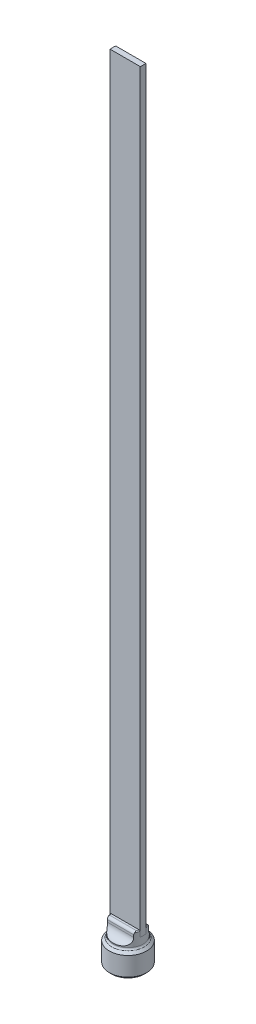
ISO-10303-21;
HEADER;
FILE_DESCRIPTION(('STEP AP214'),'2;1');
FILE_NAME('part.step','',(''),(''),'','','');
FILE_SCHEMA(('AUTOMOTIVE_DESIGN { 1 0 10303 214 1 1 1 1 }'));
ENDSEC;
DATA;
#1=APPLICATION_CONTEXT('core data for automotive mechanical design processes');
#2=APPLICATION_PROTOCOL_DEFINITION('international standard','automotive_design',2000,#1);
#3=PRODUCT_CONTEXT('',#1,'mechanical');
#4=PRODUCT('Part','Part','',(#3));
#5=PRODUCT_RELATED_PRODUCT_CATEGORY('part','',(#4));
#6=PRODUCT_DEFINITION_FORMATION('','',#4);
#7=PRODUCT_DEFINITION_CONTEXT('part definition',#1,'design');
#8=PRODUCT_DEFINITION('design','',#6,#7);
#9=PRODUCT_DEFINITION_SHAPE('','',#8);
#10=(LENGTH_UNIT() NAMED_UNIT(*) SI_UNIT(.MILLI.,.METRE.));
#11=(NAMED_UNIT(*) PLANE_ANGLE_UNIT() SI_UNIT($,.RADIAN.));
#12=(NAMED_UNIT(*) SI_UNIT($,.STERADIAN.) SOLID_ANGLE_UNIT());
#13=UNCERTAINTY_MEASURE_WITH_UNIT(LENGTH_MEASURE(1.E-05),#10,'distance_accuracy_value','');
#14=(GEOMETRIC_REPRESENTATION_CONTEXT(3) GLOBAL_UNCERTAINTY_ASSIGNED_CONTEXT((#13)) GLOBAL_UNIT_ASSIGNED_CONTEXT((#10,
#11,#12)) REPRESENTATION_CONTEXT('',''));
#15=CARTESIAN_POINT('',(0.,0.,0.));
#16=DIRECTION('',(0.,0.,1.));
#17=DIRECTION('',(1.,0.,0.));
#18=AXIS2_PLACEMENT_3D('',#15,#16,#17);
#19=CARTESIAN_POINT('',(-2.3622,0.,1.36381680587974));
#20=DIRECTION('',(-0.5,0.,0.866025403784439));
#21=DIRECTION('',(0.866025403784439,0.,0.5));
#22=AXIS2_PLACEMENT_3D('',#19,#20,#21);
#23=PLANE('',#22);
#24=DIRECTION('',(0.,1.,0.));
#25=VECTOR('',#24,1.);
#26=CARTESIAN_POINT('',(-2.3622,0.,1.36381680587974));
#27=LINE('',#26,#25);
#28=CARTESIAN_POINT('',(-2.36219999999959,0.0155663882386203,1.3638168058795));
#29=VERTEX_POINT('',#28);
#30=CARTESIAN_POINT('',(-2.3622,5.4102,1.36381680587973));
#31=VERTEX_POINT('',#30);
#32=EDGE_CURVE('E694',#29,#31,#27,.T.);
#33=ORIENTED_EDGE('',*,*,#32,.T.);
#34=DIRECTION('',(-0.866025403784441,0.,-0.5));
#35=VECTOR('',#34,1.);
#36=CARTESIAN_POINT('',(0.,5.4102,2.72763361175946));
#37=LINE('',#36,#35);
#38=CARTESIAN_POINT('',(0.,5.4102,2.72763361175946));
#39=VERTEX_POINT('',#38);
#40=EDGE_CURVE('E687',#39,#31,#37,.T.);
#41=ORIENTED_EDGE('',*,*,#40,.F.);
#42=DIRECTION('',(0.,1.,0.));
#43=VECTOR('',#42,1.);
#44=CARTESIAN_POINT('',(0.,0.,2.72763361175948));
#45=LINE('',#44,#43);
#46=CARTESIAN_POINT('',(-4.05896796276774E-13,0.0155663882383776,2.72763361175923));
#47=VERTEX_POINT('',#46);
#48=EDGE_CURVE('E646',#39,#47,#45,.F.);
#49=ORIENTED_EDGE('',*,*,#48,.T.);
#50=CARTESIAN_POINT('',(-2.36219999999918,0.0155663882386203,1.36381680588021));
#51=CARTESIAN_POINT('',(-2.28154043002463,0.0620917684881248,1.41038563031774));
#52=CARTESIAN_POINT('',(-2.19954081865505,0.105900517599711,1.45772812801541));
#53=CARTESIAN_POINT('',(-2.03230420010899,0.186202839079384,1.55428223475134));
#54=CARTESIAN_POINT('',(-1.94704980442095,0.222647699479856,1.60350388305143));
#55=CARTESIAN_POINT('',(-1.77407702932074,0.28558015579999,1.70336976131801));
#56=CARTESIAN_POINT('',(-1.686368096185,0.312101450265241,1.75400853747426));
#57=CARTESIAN_POINT('',(-1.50902744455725,0.352932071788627,1.85639621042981));
#58=CARTESIAN_POINT('',(-1.41940256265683,0.367279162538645,1.9081411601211));
#59=CARTESIAN_POINT('',(-1.3047260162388,0.376863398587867,1.97434969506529));
#60=CARTESIAN_POINT('',(-1.28001324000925,0.37841288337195,1.98861762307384));
#61=CARTESIAN_POINT('',(-1.23056804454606,0.38048128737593,2.01716481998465));
#62=CARTESIAN_POINT('',(-1.20583564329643,0.381000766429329,2.03144407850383));
#63=CARTESIAN_POINT('',(-1.11901839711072,0.38099807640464,2.08156803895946));
#64=CARTESIAN_POINT('',(-1.0569163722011,0.377719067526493,2.11742265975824));
#65=CARTESIAN_POINT('',(-0.933187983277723,0.364783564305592,2.18885727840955));
#66=CARTESIAN_POINT('',(-0.87156198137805,0.355122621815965,2.22443706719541));
#67=CARTESIAN_POINT('',(-0.748942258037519,0.329877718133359,2.29523159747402));
#68=CARTESIAN_POINT('',(-0.68795279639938,0.314266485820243,2.33044387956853));
#69=CARTESIAN_POINT('',(-0.567144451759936,0.277831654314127,2.40019260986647));
#70=CARTESIAN_POINT('',(-0.507326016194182,0.25700610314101,2.43472879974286));
#71=CARTESIAN_POINT('',(-0.370927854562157,0.203889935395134,2.51347831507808));
#72=CARTESIAN_POINT('',(-0.294808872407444,0.170040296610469,2.55742562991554));
#73=CARTESIAN_POINT('',(-0.145452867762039,0.0966774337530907,2.64365635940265));
#74=CARTESIAN_POINT('',(-0.0721958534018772,0.0572188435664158,2.68595131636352));
#75=CARTESIAN_POINT('',(-8.22908622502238E-13,0.0155663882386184,2.72763361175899));
#76=B_SPLINE_CURVE_WITH_KNOTS('',3,(#50,#51,#52,#53,#54,#55,#56,#57,#58,#59,#60,#61,#62,#63,#64,
#65,#66,#67,#68,#69,#70,#71,#72,#73,#74,#75),.UNSPECIFIED.,.F.,.F.,(4,2,2,2,2,2,2,2,2,2,2,2,4),
(0.,0.312550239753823,0.627104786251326,0.940581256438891,1.25308174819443,1.33880263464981,
1.42447691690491,1.63950252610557,1.85467816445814,2.07085208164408,2.28710704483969,
2.56941094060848,2.84913273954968),.UNSPECIFIED.);
#77=EDGE_CURVE('E39',#29,#47,#76,.T.);
#78=ORIENTED_EDGE('',*,*,#77,.F.);
#79=EDGE_LOOP('',(#33,#41,#49,#78));
#80=FACE_BOUND('',#79,.T.);
#81=ADVANCED_FACE('F35',(#80),#23,.F.);
#82=CARTESIAN_POINT('',(-2.3622,0.,-1.36381680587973));
#83=DIRECTION('',(-1.,0.,0.));
#84=DIRECTION('',(0.,0.,1.));
#85=AXIS2_PLACEMENT_3D('',#82,#83,#84);
#86=PLANE('',#85);
#87=DIRECTION('',(0.,1.,0.));
#88=VECTOR('',#87,1.);
#89=CARTESIAN_POINT('',(-2.3622,0.,-1.36381680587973));
#90=LINE('',#89,#88);
#91=CARTESIAN_POINT('',(-2.36219999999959,0.0155663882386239,-1.36381680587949));
#92=VERTEX_POINT('',#91);
#93=CARTESIAN_POINT('',(-2.3622,5.4102,-1.36381680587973));
#94=VERTEX_POINT('',#93);
#95=EDGE_CURVE('E645',#92,#94,#90,.T.);
#96=ORIENTED_EDGE('',*,*,#95,.T.);
#97=DIRECTION('',(0.,0.,-1.));
#98=VECTOR('',#97,1.);
#99=CARTESIAN_POINT('',(-2.3622,5.4102,0.));
#100=LINE('',#99,#98);
#101=EDGE_CURVE('E672',#31,#94,#100,.T.);
#102=ORIENTED_EDGE('',*,*,#101,.F.);
#103=ORIENTED_EDGE('',*,*,#32,.F.);
#104=CARTESIAN_POINT('',(-2.3622,0.015566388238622,-1.36381680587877));
#105=CARTESIAN_POINT('',(-2.3622,0.0620917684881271,-1.27067915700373));
#106=CARTESIAN_POINT('',(-2.3622,0.105900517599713,-1.17599416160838));
#107=CARTESIAN_POINT('',(-2.3622,0.186202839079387,-0.982885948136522));
#108=CARTESIAN_POINT('',(-2.3622,0.222647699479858,-0.884442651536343));
#109=CARTESIAN_POINT('',(-2.3622,0.285580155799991,-0.684710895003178));
#110=CARTESIAN_POINT('',(-2.3622,0.312101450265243,-0.583433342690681));
#111=CARTESIAN_POINT('',(-2.3622,0.352932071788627,-0.378657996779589));
#112=CARTESIAN_POINT('',(-2.3622,0.367279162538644,-0.275168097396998));
#113=CARTESIAN_POINT('',(-2.3622,0.376863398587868,-0.142751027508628));
#114=CARTESIAN_POINT('',(-2.3622,0.37841288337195,-0.11421517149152));
#115=CARTESIAN_POINT('',(-2.3622,0.380481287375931,-0.0571207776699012));
#116=CARTESIAN_POINT('',(-2.3622,0.38100076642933,-0.0285622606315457));
#117=CARTESIAN_POINT('',(-2.3622,0.38099807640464,0.0716856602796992));
#118=CARTESIAN_POINT('',(-2.3622,0.377719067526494,0.143394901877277));
#119=CARTESIAN_POINT('',(-2.3622,0.364783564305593,0.286264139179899));
#120=CARTESIAN_POINT('',(-2.3622,0.355122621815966,0.357423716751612));
#121=CARTESIAN_POINT('',(-2.3622,0.329877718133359,0.499012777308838));
#122=CARTESIAN_POINT('',(-2.3622,0.314266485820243,0.569437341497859));
#123=CARTESIAN_POINT('',(-2.3622,0.277831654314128,0.70893480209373));
#124=CARTESIAN_POINT('',(-2.3622,0.257006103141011,0.778007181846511));
#125=CARTESIAN_POINT('',(-2.3622,0.203889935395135,0.93550621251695));
#126=CARTESIAN_POINT('',(-2.3622,0.170040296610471,1.02340084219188));
#127=CARTESIAN_POINT('',(-2.3622,0.0966774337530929,1.1958623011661));
#128=CARTESIAN_POINT('',(-2.3622,0.0572188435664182,1.28045221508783));
#129=CARTESIAN_POINT('',(-2.3622,0.0155663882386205,1.36381680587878));
#130=B_SPLINE_CURVE_WITH_KNOTS('',3,(#104,#105,#106,#107,#108,#109,#110,#111,#112,#113,#114,
#115,#116,#117,#118,#119,#120,#121,#122,#123,#124,#125,#126,#127,#128,#129),.UNSPECIFIED.,.F.,
.F.,(4,2,2,2,2,2,2,2,2,2,2,2,4),(0.,0.312550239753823,0.627104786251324,0.940581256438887,
1.25308174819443,1.3388026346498,1.42447691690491,1.63950252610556,1.85467816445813,
2.07085208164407,2.28710704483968,2.56941094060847,2.84913273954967),.UNSPECIFIED.);
#131=EDGE_CURVE('E153',#92,#29,#130,.T.);
#132=ORIENTED_EDGE('',*,*,#131,.F.);
#133=EDGE_LOOP('',(#96,#102,#103,#132));
#134=FACE_BOUND('',#133,.T.);
#135=ADVANCED_FACE('F655',(#134),#86,.F.);
#136=CARTESIAN_POINT('',(0.,0.,2.72763361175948));
#137=DIRECTION('',(0.5,0.,0.866025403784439));
#138=DIRECTION('',(0.866025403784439,0.,-0.5));
#139=AXIS2_PLACEMENT_3D('',#136,#137,#138);
#140=PLANE('',#139);
#141=ORIENTED_EDGE('',*,*,#48,.F.);
#142=DIRECTION('',(-0.866025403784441,0.,0.5));
#143=VECTOR('',#142,1.);
#144=CARTESIAN_POINT('',(2.3622,5.4102,1.36381680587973));
#145=LINE('',#144,#143);
#146=CARTESIAN_POINT('',(2.3622,5.4102,1.36381680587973));
#147=VERTEX_POINT('',#146);
#148=EDGE_CURVE('E689',#147,#39,#145,.T.);
#149=ORIENTED_EDGE('',*,*,#148,.F.);
#150=DIRECTION('',(0.,1.,0.));
#151=VECTOR('',#150,1.);
#152=CARTESIAN_POINT('',(2.3622,0.,1.36381680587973));
#153=LINE('',#152,#151);
#154=CARTESIAN_POINT('',(2.36219999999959,0.0155663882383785,1.36381680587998));
#155=VERTEX_POINT('',#154);
#156=EDGE_CURVE('E1001',#147,#155,#153,.F.);
#157=ORIENTED_EDGE('',*,*,#156,.T.);
#158=CARTESIAN_POINT('',(8.34335602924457E-13,0.0155663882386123,2.727633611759));
#159=CARTESIAN_POINT('',(0.0806595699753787,0.0620917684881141,2.68106478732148));
#160=CARTESIAN_POINT('',(0.162659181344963,0.105900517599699,2.63372228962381));
#161=CARTESIAN_POINT('',(0.329895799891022,0.186202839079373,2.53716818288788));
#162=CARTESIAN_POINT('',(0.415150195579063,0.222647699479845,2.48794653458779));
#163=CARTESIAN_POINT('',(0.588122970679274,0.285580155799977,2.3880806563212));
#164=CARTESIAN_POINT('',(0.675831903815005,0.312101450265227,2.33744188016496));
#165=CARTESIAN_POINT('',(0.853172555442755,0.352932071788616,2.23505420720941));
#166=CARTESIAN_POINT('',(0.942797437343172,0.367279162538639,2.18330925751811));
#167=CARTESIAN_POINT('',(1.0574739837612,0.376863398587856,2.11710072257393));
#168=CARTESIAN_POINT('',(1.08218675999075,0.378412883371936,2.10283279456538));
#169=CARTESIAN_POINT('',(1.13163195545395,0.380481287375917,2.07428559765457));
#170=CARTESIAN_POINT('',(1.15636435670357,0.381000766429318,2.06000633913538));
#171=CARTESIAN_POINT('',(1.24318160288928,0.380998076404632,2.00988237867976));
#172=CARTESIAN_POINT('',(1.3052836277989,0.377719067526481,1.97402775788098));
#173=CARTESIAN_POINT('',(1.42901201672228,0.364783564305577,1.90259313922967));
#174=CARTESIAN_POINT('',(1.49063801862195,0.355122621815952,1.86701335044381));
#175=CARTESIAN_POINT('',(1.61325774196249,0.329877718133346,1.7962188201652));
#176=CARTESIAN_POINT('',(1.67424720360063,0.314266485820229,1.76100653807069));
#177=CARTESIAN_POINT('',(1.79505554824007,0.277831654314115,1.69125780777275));
#178=CARTESIAN_POINT('',(1.85487398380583,0.257006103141,1.65672161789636));
#179=CARTESIAN_POINT('',(1.99127214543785,0.203889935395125,1.57797210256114));
#180=CARTESIAN_POINT('',(2.06739112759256,0.170040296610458,1.53402478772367));
#181=CARTESIAN_POINT('',(2.21674713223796,0.096677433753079,1.44779405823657));
#182=CARTESIAN_POINT('',(2.29000414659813,0.0572188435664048,1.4054991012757));
#183=CARTESIAN_POINT('',(2.36219999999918,0.0155663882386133,1.36381680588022));
#184=B_SPLINE_CURVE_WITH_KNOTS('',3,(#158,#159,#160,#161,#162,#163,#164,#165,#166,#167,#168,
#169,#170,#171,#172,#173,#174,#175,#176,#177,#178,#179,#180,#181,#182,#183),.UNSPECIFIED.,.F.,
.F.,(4,2,2,2,2,2,2,2,2,2,2,2,4),(0.,0.31255023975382,0.627104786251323,0.940581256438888,
1.25308174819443,1.3388026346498,1.4244769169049,1.63950252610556,1.85467816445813,
2.07085208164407,2.28710704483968,2.56941094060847,2.84913273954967),.UNSPECIFIED.);
#185=EDGE_CURVE('E639',#47,#155,#184,.T.);
#186=ORIENTED_EDGE('',*,*,#185,.F.);
#187=EDGE_LOOP('',(#141,#149,#157,#186));
#188=FACE_BOUND('',#187,.T.);
#189=ADVANCED_FACE('F651',(#188),#140,.F.);
#190=CARTESIAN_POINT('',(0.,0.,-2.72763361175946));
#191=DIRECTION('',(-0.5,0.,-0.866025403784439));
#192=DIRECTION('',(-0.866025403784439,0.,0.5));
#193=AXIS2_PLACEMENT_3D('',#190,#191,#192);
#194=PLANE('',#193);
#195=DIRECTION('',(0.,1.,0.));
#196=VECTOR('',#195,1.);
#197=CARTESIAN_POINT('',(0.,0.,-2.72763361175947));
#198=LINE('',#197,#196);
#199=CARTESIAN_POINT('',(0.,0.0155663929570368,-2.72763360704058));
#200=VERTEX_POINT('',#199);
#201=CARTESIAN_POINT('',(0.,5.4102,-2.72763361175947));
#202=VERTEX_POINT('',#201);
#203=EDGE_CURVE('E679',#200,#202,#198,.T.);
#204=ORIENTED_EDGE('',*,*,#203,.T.);
#205=DIRECTION('',(0.866025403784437,0.,-0.5));
#206=VECTOR('',#205,1.);
#207=CARTESIAN_POINT('',(-2.3622,5.4102,-1.36381680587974));
#208=LINE('',#207,#206);
#209=EDGE_CURVE('E677',#94,#202,#208,.T.);
#210=ORIENTED_EDGE('',*,*,#209,.F.);
#211=ORIENTED_EDGE('',*,*,#95,.F.);
#212=CARTESIAN_POINT('',(-6.58945370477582E-09,0.0155663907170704,-2.72763360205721));
#213=CARTESIAN_POINT('',(-0.0806595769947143,0.0620917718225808,-2.6810647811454));
#214=CARTESIAN_POINT('',(-0.162659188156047,0.105900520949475,-2.63372228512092));
#215=CARTESIAN_POINT('',(-0.329895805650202,0.186202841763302,-2.53716818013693));
#216=CARTESIAN_POINT('',(-0.415150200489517,0.222647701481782,-2.48794653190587));
#217=CARTESIAN_POINT('',(-0.588122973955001,0.285580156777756,-2.3880806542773));
#218=CARTESIAN_POINT('',(-0.675831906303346,0.312101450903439,-2.337441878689));
#219=CARTESIAN_POINT('',(-0.853172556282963,0.352932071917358,-2.23505420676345));
#220=CARTESIAN_POINT('',(-0.942797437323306,0.367279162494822,-2.18330925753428));
#221=CARTESIAN_POINT('',(-1.05747398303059,0.376863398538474,-2.11710072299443));
#222=CARTESIAN_POINT('',(-1.08218675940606,0.378412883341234,-2.10283279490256));
#223=CARTESIAN_POINT('',(-1.13163195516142,0.380481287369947,-2.07428559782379));
#224=CARTESIAN_POINT('',(-1.15636435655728,0.3810007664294,-2.06000633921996));
#225=CARTESIAN_POINT('',(-1.24318160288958,0.380998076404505,-2.00988237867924));
#226=CARTESIAN_POINT('',(-1.30528362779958,0.377719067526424,-1.97402775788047));
#227=CARTESIAN_POINT('',(-1.42901201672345,0.364783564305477,-1.90259313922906));
#228=CARTESIAN_POINT('',(-1.49063801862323,0.355122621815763,-1.86701335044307));
#229=CARTESIAN_POINT('',(-1.61325774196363,0.329877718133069,-1.79621882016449));
#230=CARTESIAN_POINT('',(-1.67424720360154,0.314266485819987,-1.76100653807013));
#231=CARTESIAN_POINT('',(-1.79505554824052,0.277831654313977,-1.69125780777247));
#232=CARTESIAN_POINT('',(-1.85487398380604,0.257006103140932,-1.65672161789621));
#233=CARTESIAN_POINT('',(-1.99127214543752,0.203889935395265,-1.5779721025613));
#234=CARTESIAN_POINT('',(-2.06739112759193,0.170040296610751,-1.53402478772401));
#235=CARTESIAN_POINT('',(-2.21674713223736,0.0966774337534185,-1.44779405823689));
#236=CARTESIAN_POINT('',(-2.29000414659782,0.0572188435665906,-1.40549910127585));
#237=CARTESIAN_POINT('',(-2.36219999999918,0.0155663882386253,-1.3638168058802));
#238=B_SPLINE_CURVE_WITH_KNOTS('',3,(#212,#213,#214,#215,#216,#217,#218,#219,#220,#221,#222,
#223,#224,#225,#226,#227,#228,#229,#230,#231,#232,#233,#234,#235,#236,#237),.UNSPECIFIED.,.F.,
.F.,(4,2,2,2,2,2,2,2,2,2,2,2,4),(0.,0.312550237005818,0.627104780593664,0.940581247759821,
1.25308173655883,1.33880262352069,1.42447690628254,1.63950251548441,1.8546781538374,
2.07085207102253,2.28710703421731,2.56941092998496,2.84913272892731),.UNSPECIFIED.);
#239=EDGE_CURVE('E632',#200,#92,#238,.T.);
#240=ORIENTED_EDGE('',*,*,#239,.F.);
#241=EDGE_LOOP('',(#204,#210,#211,#240));
#242=FACE_BOUND('',#241,.T.);
#243=ADVANCED_FACE('F654',(#242),#194,.F.);
#244=CARTESIAN_POINT('',(0.,5.4102,0.));
#245=DIRECTION('',(0.,-1.,0.));
#246=DIRECTION('',(0.,0.,-1.));
#247=AXIS2_PLACEMENT_3D('',#244,#245,#246);
#248=PLANE('',#247);
#249=ORIENTED_EDGE('',*,*,#101,.T.);
#250=ORIENTED_EDGE('',*,*,#209,.T.);
#251=DIRECTION('',(-0.866025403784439,0.,-0.5));
#252=VECTOR('',#251,1.);
#253=CARTESIAN_POINT('',(2.3622,5.4102,-1.36381680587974));
#254=LINE('',#253,#252);
#255=CARTESIAN_POINT('',(2.3622,5.4102,-1.36381680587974));
#256=VERTEX_POINT('',#255);
#257=EDGE_CURVE('E1011',#202,#256,#254,.F.);
#258=ORIENTED_EDGE('',*,*,#257,.T.);
#259=DIRECTION('',(0.,0.,-1.));
#260=VECTOR('',#259,1.);
#261=CARTESIAN_POINT('',(2.3622,5.4102,1.36381680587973));
#262=LINE('',#261,#260);
#263=EDGE_CURVE('E682',#256,#147,#262,.F.);
#264=ORIENTED_EDGE('',*,*,#263,.T.);
#265=ORIENTED_EDGE('',*,*,#148,.T.);
#266=ORIENTED_EDGE('',*,*,#40,.T.);
#267=EDGE_LOOP('',(#249,#250,#258,#264,#265,#266));
#268=FACE_BOUND('',#267,.T.);
#269=ADVANCED_FACE('F684',(#268),#248,.T.);
#270=CARTESIAN_POINT('',(2.3622,0.,1.36381680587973));
#271=DIRECTION('',(1.,0.,0.));
#272=DIRECTION('',(0.,0.,-1.));
#273=AXIS2_PLACEMENT_3D('',#270,#271,#272);
#274=PLANE('',#273);
#275=ORIENTED_EDGE('',*,*,#156,.F.);
#276=ORIENTED_EDGE('',*,*,#263,.F.);
#277=DIRECTION('',(0.,1.,0.));
#278=VECTOR('',#277,1.);
#279=CARTESIAN_POINT('',(2.3622,0.,-1.36381680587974));
#280=LINE('',#279,#278);
#281=CARTESIAN_POINT('',(2.3622,0.0155663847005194,-1.36381681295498));
#282=VERTEX_POINT('',#281);
#283=EDGE_CURVE('E1012',#256,#282,#280,.F.);
#284=ORIENTED_EDGE('',*,*,#283,.T.);
#285=CARTESIAN_POINT('',(2.3622,0.0155663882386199,1.36381680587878));
#286=CARTESIAN_POINT('',(2.3622,0.062091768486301,1.27067915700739));
#287=CARTESIAN_POINT('',(2.3622,0.105900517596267,1.17599416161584));
#288=CARTESIAN_POINT('',(2.3622,0.186202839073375,0.982885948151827));
#289=CARTESIAN_POINT('',(2.3622,0.222647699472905,0.884442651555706));
#290=CARTESIAN_POINT('',(2.3622,0.285580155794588,0.684710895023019));
#291=CARTESIAN_POINT('',(2.3622,0.312101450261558,0.583433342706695));
#292=CARTESIAN_POINT('',(2.3622,0.352932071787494,0.378657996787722));
#293=CARTESIAN_POINT('',(2.3622,0.367279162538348,0.275168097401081));
#294=CARTESIAN_POINT('',(2.3622,0.376863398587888,0.142751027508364));
#295=CARTESIAN_POINT('',(2.3622,0.37841288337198,0.114215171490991));
#296=CARTESIAN_POINT('',(2.3622,0.380481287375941,0.057120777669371));
#297=CARTESIAN_POINT('',(2.3622,0.38100076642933,0.0285622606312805));
#298=CARTESIAN_POINT('',(2.3622,0.380998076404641,-0.0716856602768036));
#299=CARTESIAN_POINT('',(2.3622,0.377719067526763,-0.143394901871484));
#300=CARTESIAN_POINT('',(2.3622,0.364783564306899,-0.286264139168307));
#301=CARTESIAN_POINT('',(2.3622,0.355122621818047,-0.35742371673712));
#302=CARTESIAN_POINT('',(2.3622,0.329877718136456,-0.499012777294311));
#303=CARTESIAN_POINT('',(2.3622,0.314266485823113,-0.569437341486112));
#304=CARTESIAN_POINT('',(2.3622,0.277831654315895,-0.708934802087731));
#305=CARTESIAN_POINT('',(2.3622,0.257006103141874,-0.778007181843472));
#306=CARTESIAN_POINT('',(2.3622,0.203889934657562,-0.935506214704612));
#307=CARTESIAN_POINT('',(2.3622,0.170040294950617,-1.02340084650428));
#308=CARTESIAN_POINT('',(2.3622,0.096677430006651,-1.19586230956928));
#309=CARTESIAN_POINT('',(2.3622,0.0572188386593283,-1.28045222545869));
#310=CARTESIAN_POINT('',(2.3622,0.0155663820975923,-1.36381681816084));
#311=B_SPLINE_CURVE_WITH_KNOTS('',3,(#285,#286,#287,#288,#289,#290,#291,#292,#293,#294,#295,
#296,#297,#298,#299,#300,#301,#302,#303,#304,#305,#306,#307,#308,#309,#310),.UNSPECIFIED.,.F.,
.F.,(4,2,2,2,2,2,2,2,2,2,2,2,4),(0.,0.312550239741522,0.627104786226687,0.940581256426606,
1.25308174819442,1.33880263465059,1.4244769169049,1.63950252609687,1.85467816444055,
2.07085208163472,2.28710704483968,2.5694109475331,2.84913275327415),.UNSPECIFIED.);
#312=EDGE_CURVE('E626',#155,#282,#311,.T.);
#313=ORIENTED_EDGE('',*,*,#312,.F.);
#314=EDGE_LOOP('',(#275,#276,#284,#313));
#315=FACE_BOUND('',#314,.T.);
#316=ADVANCED_FACE('F937',(#315),#274,.F.);
#317=CARTESIAN_POINT('',(2.3622,0.,-1.36381680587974));
#318=DIRECTION('',(0.5,0.,-0.866025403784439));
#319=DIRECTION('',(-0.866025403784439,0.,-0.5));
#320=AXIS2_PLACEMENT_3D('',#317,#318,#319);
#321=PLANE('',#320);
#322=ORIENTED_EDGE('',*,*,#283,.F.);
#323=ORIENTED_EDGE('',*,*,#257,.F.);
#324=ORIENTED_EDGE('',*,*,#203,.F.);
#325=CARTESIAN_POINT('',(8.17335955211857E-09,0.0155663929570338,-2.72763360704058));
#326=CARTESIAN_POINT('',(0.0806595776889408,0.0620917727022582,-2.68106478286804));
#327=CARTESIAN_POINT('',(0.16265918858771,0.105900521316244,-2.63372228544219));
#328=CARTESIAN_POINT('',(0.32989580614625,0.186202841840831,-2.5371681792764));
#329=CARTESIAN_POINT('',(0.41515020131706,0.222647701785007,-2.48794653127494));
#330=CARTESIAN_POINT('',(0.588122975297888,0.285580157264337,-2.38808065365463));
#331=CARTESIAN_POINT('',(0.675831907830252,0.31210145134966,-2.33744187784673));
#332=CARTESIAN_POINT('',(0.853172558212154,0.352932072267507,-2.23505420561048));
#333=CARTESIAN_POINT('',(0.942797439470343,0.367279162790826,-2.18330925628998));
#334=CARTESIAN_POINT('',(1.05747398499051,0.376863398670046,-2.11710072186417));
#335=CARTESIAN_POINT('',(1.08218676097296,0.378412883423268,-2.10283279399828));
#336=CARTESIAN_POINT('',(1.13163195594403,0.380481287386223,-2.0742855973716));
#337=CARTESIAN_POINT('',(1.15636435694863,0.381000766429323,-2.06000633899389));
#338=CARTESIAN_POINT('',(1.24318160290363,0.380998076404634,-2.00988237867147));
#339=CARTESIAN_POINT('',(1.30528362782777,0.377719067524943,-1.9740277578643));
#340=CARTESIAN_POINT('',(1.4290120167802,0.364783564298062,-1.90259313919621));
#341=CARTESIAN_POINT('',(1.4906380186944,0.355122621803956,-1.86701335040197));
#342=CARTESIAN_POINT('',(1.61325774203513,0.329877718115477,-1.79621882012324));
#343=CARTESIAN_POINT('',(1.67424720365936,0.314266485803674,-1.76100653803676));
#344=CARTESIAN_POINT('',(1.79505554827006,0.277831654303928,-1.69125780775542));
#345=CARTESIAN_POINT('',(1.85487398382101,0.257006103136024,-1.65672161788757));
#346=CARTESIAN_POINT('',(1.99127213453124,0.203889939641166,-1.57797210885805));
#347=CARTESIAN_POINT('',(2.06739110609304,0.170040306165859,-1.53402480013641));
#348=CARTESIAN_POINT('',(2.21674709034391,0.0966774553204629,-1.4477940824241));
#349=CARTESIAN_POINT('',(2.29000409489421,0.0572188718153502,-1.40549913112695));
#350=CARTESIAN_POINT('',(2.362199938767,0.0155664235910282,-1.36381684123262));
#351=B_SPLINE_CURVE_WITH_KNOTS('',3,(#325,#326,#327,#328,#329,#330,#331,#332,#333,#334,#335,
#336,#337,#338,#339,#340,#341,#342,#343,#344,#345,#346,#347,#348,#349,#350),.UNSPECIFIED.,.F.,
.F.,(4,2,2,2,2,2,2,2,2,2,2,2,4),(0.,0.312550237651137,0.627104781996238,0.940581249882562,
1.25308173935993,1.33880262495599,1.42447690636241,1.63950251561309,1.85467815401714,
2.07085207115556,2.28710703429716,2.56941089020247,2.84913264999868),.UNSPECIFIED.);
#352=EDGE_CURVE('E618',#200,#282,#351,.T.);
#353=ORIENTED_EDGE('',*,*,#352,.T.);
#354=EDGE_LOOP('',(#322,#323,#324,#353));
#355=FACE_BOUND('',#354,.T.);
#356=ADVANCED_FACE('F609',(#355),#321,.F.);
#357=CARTESIAN_POINT('',(0.,-5.68440337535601E-11,0.));
#358=DIRECTION('',(0.,-1.,0.));
#359=DIRECTION('',(0.,0.,-1.));
#360=AXIS2_PLACEMENT_3D('',#357,#358,#359);
#361=CONICAL_SURFACE('',#360,2.74320000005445,0.785398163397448);
#362=CARTESIAN_POINT('',(0.,-5.68444674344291E-11,0.));
#363=DIRECTION('',(0.,-1.,0.));
#364=DIRECTION('',(0.,0.,-1.));
#365=AXIS2_PLACEMENT_3D('',#362,#363,#364);
#366=CIRCLE('',#365,2.74320000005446);
#367=CARTESIAN_POINT('',(0.,-5.68450823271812E-11,-2.74320000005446));
#368=VERTEX_POINT('',#367);
#369=EDGE_CURVE('E1015',#368,#368,#366,.F.);
#370=ORIENTED_EDGE('',*,*,#369,.F.);
#371=EDGE_LOOP('',(#370));
#372=FACE_BOUND('',#371,.T.);
#373=ORIENTED_EDGE('',*,*,#352,.F.);
#374=ORIENTED_EDGE('',*,*,#239,.T.);
#375=ORIENTED_EDGE('',*,*,#131,.T.);
#376=ORIENTED_EDGE('',*,*,#77,.T.);
#377=ORIENTED_EDGE('',*,*,#185,.T.);
#378=ORIENTED_EDGE('',*,*,#312,.T.);
#379=EDGE_LOOP('',(#373,#374,#375,#376,#377,#378));
#380=FACE_BOUND('',#379,.T.);
#381=ADVANCED_FACE('F604',(#372,#380),#361,.F.);
#382=CARTESIAN_POINT('',(0.,0.,-2.3622));
#383=DIRECTION('',(0.,-1.,0.));
#384=DIRECTION('',(0.,0.,-1.));
#385=AXIS2_PLACEMENT_3D('',#382,#383,#384);
#386=PLANE('',#385);
#387=ORIENTED_EDGE('',*,*,#369,.T.);
#388=EDGE_LOOP('',(#387));
#389=FACE_BOUND('',#388,.T.);
#390=CARTESIAN_POINT('',(0.,-1.13686946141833E-10,0.));
#391=DIRECTION('',(0.,1.,0.));
#392=DIRECTION('',(0.,0.,1.));
#393=AXIS2_PLACEMENT_3D('',#390,#391,#392);
#394=CIRCLE('',#393,4.19099999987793);
#395=CARTESIAN_POINT('',(0.,-1.13686001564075E-10,4.19099999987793));
#396=VERTEX_POINT('',#395);
#397=EDGE_CURVE('E1024',#396,#396,#394,.T.);
#398=ORIENTED_EDGE('',*,*,#397,.F.);
#399=EDGE_LOOP('',(#398));
#400=FACE_BOUND('',#399,.T.);
#401=ADVANCED_FACE('F601',(#389,#400),#386,.T.);
#402=CARTESIAN_POINT('',(0.,0.619499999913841,0.));
#403=DIRECTION('',(0.,1.,0.));
#404=DIRECTION('',(0.,0.,1.));
#405=AXIS2_PLACEMENT_3D('',#402,#403,#404);
#406=CONICAL_SURFACE('',#405,4.81049999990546,0.785398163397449);
#407=CARTESIAN_POINT('',(0.,0.6195,0.));
#408=DIRECTION('',(0.,-1.,0.));
#409=DIRECTION('',(0.,0.,-1.));
#410=AXIS2_PLACEMENT_3D('',#407,#408,#409);
#411=CIRCLE('',#410,4.8105);
#412=CARTESIAN_POINT('',(0.,0.619499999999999,-4.8105));
#413=VERTEX_POINT('',#412);
#414=EDGE_CURVE('E1020',#413,#413,#411,.F.);
#415=ORIENTED_EDGE('',*,*,#414,.F.);
#416=EDGE_LOOP('',(#415));
#417=FACE_BOUND('',#416,.T.);
#418=ORIENTED_EDGE('',*,*,#397,.T.);
#419=EDGE_LOOP('',(#418));
#420=FACE_BOUND('',#419,.T.);
#421=ADVANCED_FACE('F597',(#417,#420),#406,.T.);
#422=CARTESIAN_POINT('',(0.,3.048,0.));
#423=DIRECTION('',(0.,-1.,0.));
#424=DIRECTION('',(0.,0.,-1.));
#425=AXIS2_PLACEMENT_3D('',#422,#423,#424);
#426=CYLINDRICAL_SURFACE('',#425,4.8105);
#427=CARTESIAN_POINT('',(0.,5.47649999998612,0.));
#428=DIRECTION('',(0.,-1.,0.));
#429=DIRECTION('',(0.,0.,1.));
#430=AXIS2_PLACEMENT_3D('',#427,#428,#429);
#431=CIRCLE('',#430,4.81050000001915);
#432=CARTESIAN_POINT('',(0.,5.47649999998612,4.81050000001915));
#433=VERTEX_POINT('',#432);
#434=EDGE_CURVE('E1017',#433,#433,#431,.F.);
#435=ORIENTED_EDGE('',*,*,#434,.F.);
#436=EDGE_LOOP('',(#435));
#437=FACE_BOUND('',#436,.T.);
#438=ORIENTED_EDGE('',*,*,#414,.T.);
#439=EDGE_LOOP('',(#438));
#440=FACE_BOUND('',#439,.T.);
#441=ADVANCED_FACE('F593',(#437,#440),#426,.T.);
#442=CARTESIAN_POINT('',(0.,5.4765000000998,0.));
#443=DIRECTION('',(0.,-1.,0.));
#444=DIRECTION('',(0.,0.,-1.));
#445=AXIS2_PLACEMENT_3D('',#442,#443,#444);
#446=CONICAL_SURFACE('',#445,4.81049999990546,0.785398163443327);
#447=CARTESIAN_POINT('',(0.,6.096,0.));
#448=DIRECTION('',(0.,-1.,0.));
#449=DIRECTION('',(0.,0.,-1.));
#450=AXIS2_PLACEMENT_3D('',#447,#448,#449);
#451=CIRCLE('',#450,4.191);
#452=CARTESIAN_POINT('',(0.,6.096,-4.191));
#453=VERTEX_POINT('',#452);
#454=EDGE_CURVE('E581',#453,#453,#451,.T.);
#455=ORIENTED_EDGE('',*,*,#454,.T.);
#456=EDGE_LOOP('',(#455));
#457=FACE_BOUND('',#456,.T.);
#458=ORIENTED_EDGE('',*,*,#434,.T.);
#459=EDGE_LOOP('',(#458));
#460=FACE_BOUND('',#459,.T.);
#461=ADVANCED_FACE('F588',(#457,#460),#446,.T.);
#462=CARTESIAN_POINT('',(0.,6.5615896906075,0.));
#463=DIRECTION('',(0.,-1.,0.));
#464=DIRECTION('',(0.,0.,-1.));
#465=AXIS2_PLACEMENT_3D('',#462,#463,#464);
#466=TOROIDAL_SURFACE('',#465,4.39420000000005,0.508);
#467=ORIENTED_EDGE('',*,*,#454,.F.);
#468=EDGE_LOOP('',(#467));
#469=FACE_BOUND('',#468,.T.);
#470=CARTESIAN_POINT('',(0.,6.5615896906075,0.));
#471=DIRECTION('',(0.,-1.,0.));
#472=DIRECTION('',(0.,0.,-1.));
#473=AXIS2_PLACEMENT_3D('',#470,#471,#472);
#474=CIRCLE('',#473,3.8862);
#475=CARTESIAN_POINT('',(0.,6.5615896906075,-3.8862));
#476=VERTEX_POINT('',#475);
#477=EDGE_CURVE('E724',#476,#476,#474,.F.);
#478=ORIENTED_EDGE('',*,*,#477,.F.);
#479=EDGE_LOOP('',(#478));
#480=FACE_BOUND('',#479,.T.);
#481=ADVANCED_FACE('F584',(#469,#480),#466,.F.);
#482=CARTESIAN_POINT('',(0.,8.763,-3.8608));
#483=DIRECTION('',(1.,0.,0.));
#484=DIRECTION('',(0.,0.,-1.));
#485=AXIS2_PLACEMENT_3D('',#482,#483,#484);
#486=CYLINDRICAL_SURFACE('',#485,1.9558);
#487=DIRECTION('',(1.,0.,0.));
#488=VECTOR('',#487,1.);
#489=CARTESIAN_POINT('',(0.,8.763,-1.905));
#490=LINE('',#489,#488);
#491=CARTESIAN_POINT('',(-3.38725928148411,8.763,-1.905));
#492=VERTEX_POINT('',#491);
#493=CARTESIAN_POINT('',(3.38725928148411,8.763,-1.905));
#494=VERTEX_POINT('',#493);
#495=EDGE_CURVE('E731',#492,#494,#490,.T.);
#496=ORIENTED_EDGE('',*,*,#495,.T.);
#497=CARTESIAN_POINT('',(-3.3872592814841,8.763,-1.905));
#498=CARTESIAN_POINT('',(-3.38725570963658,8.7148407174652,-1.90499261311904));
#499=CARTESIAN_POINT('',(-3.38625874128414,8.66668356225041,-1.9067786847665));
#500=CARTESIAN_POINT('',(-3.3822530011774,8.57071712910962,-1.91388232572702));
#501=CARTESIAN_POINT('',(-3.379244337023,8.52290783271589,-1.91919970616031));
#502=CARTESIAN_POINT('',(-3.37119526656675,8.42803523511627,-1.93330167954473));
#503=CARTESIAN_POINT('',(-3.36615742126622,8.38097107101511,-1.94208190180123));
#504=CARTESIAN_POINT('',(-3.35400900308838,8.2878785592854,-1.96298723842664));
#505=CARTESIAN_POINT('',(-3.3468984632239,8.24185019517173,-1.97511229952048));
#506=CARTESIAN_POINT('',(-3.32236041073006,8.10575585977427,-2.01631092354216));
#507=CARTESIAN_POINT('',(-3.30172410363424,8.01765158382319,-2.05021234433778));
#508=CARTESIAN_POINT('',(-3.25146765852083,7.84938541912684,-2.12900761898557));
#509=CARTESIAN_POINT('',(-3.22185082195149,7.76922062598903,-2.17389743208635));
#510=CARTESIAN_POINT('',(-3.15316008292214,7.61834138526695,-2.27238614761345));
#511=CARTESIAN_POINT('',(-3.11404442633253,7.54767086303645,-2.32602314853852));
#512=CARTESIAN_POINT('',(-3.0265017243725,7.41741024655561,-2.43883726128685));
#513=CARTESIAN_POINT('',(-2.97807163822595,7.35782378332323,-2.49801617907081));
#514=CARTESIAN_POINT('',(-2.8694009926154,7.24691267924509,-2.62226563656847));
#515=CARTESIAN_POINT('',(-2.80864060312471,7.19626216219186,-2.68747915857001));
#516=CARTESIAN_POINT('',(-2.67837529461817,7.10693990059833,-2.81732404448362));
#517=CARTESIAN_POINT('',(-2.60886725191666,7.06827245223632,-2.88195519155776));
#518=CARTESIAN_POINT('',(-2.48100281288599,7.00992317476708,-2.99205611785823));
#519=CARTESIAN_POINT('',(-2.42428144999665,6.98791322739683,-3.03823265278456));
#520=CARTESIAN_POINT('',(-2.30719039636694,6.94898008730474,-3.12807709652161));
#521=CARTESIAN_POINT('',(-2.24681922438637,6.93205897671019,-3.17174397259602));
#522=CARTESIAN_POINT('',(-2.1227856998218,6.9025016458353,-3.25606705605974));
#523=CARTESIAN_POINT('',(-2.05911524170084,6.88987661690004,-3.29671518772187));
#524=CARTESIAN_POINT('',(-1.92905419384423,6.86820055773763,-3.37446958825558));
#525=CARTESIAN_POINT('',(-1.86266288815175,6.85915047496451,-3.41157491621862));
#526=CARTESIAN_POINT('',(-1.70460609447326,6.84131798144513,-3.49389104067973));
#527=CARTESIAN_POINT('',(-1.61201450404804,6.83367027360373,-3.53757497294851));
#528=CARTESIAN_POINT('',(-1.42345677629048,6.82196223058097,-3.61757113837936));
#529=CARTESIAN_POINT('',(-1.32748911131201,6.81790354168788,-3.65387998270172));
#530=CARTESIAN_POINT('',(-1.1331164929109,6.81209439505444,-3.71874654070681));
#531=CARTESIAN_POINT('',(-1.03471657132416,6.81033952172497,-3.74731899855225));
#532=CARTESIAN_POINT('',(-0.836005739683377,6.80809840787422,-3.79659244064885));
#533=CARTESIAN_POINT('',(-0.73569608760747,6.80761135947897,-3.81729843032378));
#534=CARTESIAN_POINT('',(-0.603004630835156,6.80731180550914,-3.83926717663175));
#535=CARTESIAN_POINT('',(-0.571191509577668,6.80726577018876,-3.84412873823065));
#536=CARTESIAN_POINT('',(-0.507466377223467,6.80721040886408,-3.85305898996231));
#537=CARTESIAN_POINT('',(-0.475554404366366,6.80720107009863,-3.85712795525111));
#538=CARTESIAN_POINT('',(-0.296579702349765,6.80719507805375,-3.87768966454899));
#539=CARTESIAN_POINT('',(-0.148499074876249,6.80736508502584,-3.88618222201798));
#540=CARTESIAN_POINT('',(0.14791805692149,6.80736479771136,-3.88621776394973));
#541=CARTESIAN_POINT('',(0.296254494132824,6.80719383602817,-3.87772750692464));
#542=CARTESIAN_POINT('',(0.550435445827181,6.80720446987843,-3.84852481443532));
#543=CARTESIAN_POINT('',(0.656753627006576,6.80730208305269,-3.83181281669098));
#544=CARTESIAN_POINT('',(0.867679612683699,6.80838054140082,-3.78962438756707));
#545=CARTESIAN_POINT('',(0.972286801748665,6.80936169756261,-3.76414487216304));
#546=CARTESIAN_POINT('',(1.17901991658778,6.81321973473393,-3.70459539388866));
#547=CARTESIAN_POINT('',(1.28114552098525,6.81609685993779,-3.67052432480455));
#548=CARTESIAN_POINT('',(1.48204061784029,6.82508618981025,-3.59411634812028));
#549=CARTESIAN_POINT('',(1.58081143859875,6.83119709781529,-3.55178275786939));
#550=CARTESIAN_POINT('',(1.81745861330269,6.85211370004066,-3.43850966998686));
#551=CARTESIAN_POINT('',(1.95312022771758,6.8695822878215,-3.36323439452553));
#552=CARTESIAN_POINT('',(2.14737923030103,6.907866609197,-3.23994164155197));
#553=CARTESIAN_POINT('',(2.21055654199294,6.92262856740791,-3.1971442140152));
#554=CARTESIAN_POINT('',(2.33342371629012,6.95700682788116,-3.10860278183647));
#555=CARTESIAN_POINT('',(2.39311452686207,6.97662180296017,-3.06285958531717));
#556=CARTESIAN_POINT('',(2.53879072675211,7.03332416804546,-2.94446974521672));
#557=CARTESIAN_POINT('',(2.62214063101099,7.07417923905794,-2.87029971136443));
#558=CARTESIAN_POINT('',(2.77748393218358,7.17169222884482,-2.72025091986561));
#559=CARTESIAN_POINT('',(2.84948224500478,7.22834327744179,-2.64437291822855));
#560=CARTESIAN_POINT('',(2.9478974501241,7.32633240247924,-2.53278061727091));
#561=CARTESIAN_POINT('',(2.97923781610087,7.36137274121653,-2.49577449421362));
#562=CARTESIAN_POINT('',(3.03843684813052,7.43575387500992,-2.42335077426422));
#563=CARTESIAN_POINT('',(3.06629726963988,7.47509248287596,-2.38793238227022));
#564=CARTESIAN_POINT('',(3.11844570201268,7.55793353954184,-2.31941890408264));
#565=CARTESIAN_POINT('',(3.1427343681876,7.60143522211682,-2.28632339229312));
#566=CARTESIAN_POINT('',(3.18771965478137,7.69230089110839,-2.22317254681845));
#567=CARTESIAN_POINT('',(3.20841688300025,7.73966422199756,-2.19311669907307));
#568=CARTESIAN_POINT('',(3.25981389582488,7.87306795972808,-2.11649934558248));
#569=CARTESIAN_POINT('',(3.28708686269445,7.96255255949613,-2.07349849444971));
#570=CARTESIAN_POINT('',(3.33163834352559,8.1491327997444,-2.00113994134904));
#571=CARTESIAN_POINT('',(3.34892235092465,8.24622422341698,-1.97177474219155));
#572=CARTESIAN_POINT('',(3.37015846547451,8.41373737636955,-1.93516964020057));
#573=CARTESIAN_POINT('',(3.37659011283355,8.48299541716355,-1.92388146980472));
#574=CARTESIAN_POINT('',(3.38512933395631,8.62249233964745,-1.90878757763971));
#575=CARTESIAN_POINT('',(3.38724256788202,8.6927298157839,-1.90497206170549));
#576=CARTESIAN_POINT('',(3.3872592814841,8.763,-1.905));
#577=B_SPLINE_CURVE_WITH_KNOTS('',3,(#497,#498,#499,#500,#501,#502,#503,#504,#505,#506,#507,
#508,#509,#510,#511,#512,#513,#514,#515,#516,#517,#518,#519,#520,#521,#522,#523,#524,#525,#526,
#527,#528,#529,#530,#531,#532,#533,#534,#535,#536,#537,#538,#539,#540,#541,#542,#543,#544,#545,
#546,#547,#548,#549,#550,#551,#552,#553,#554,#555,#556,#557,#558,#559,#560,#561,#562,#563,#564,
#565,#566,#567,#568,#569,#570,#571,#572,#573,#574,#575,#576),.UNSPECIFIED.,.F.,.F.,(4,2,2,2,2,2,
2,2,2,2,2,2,2,2,2,2,2,2,2,2,2,2,2,2,2,2,2,2,2,2,2,2,2,2,2,2,2,2,2,4),(0.,0.144430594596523,
0.288853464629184,0.433094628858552,0.577333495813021,0.865723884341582,1.15400838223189,
1.44358379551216,1.73325390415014,2.03961952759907,2.34609486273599,2.57493938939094,
2.80387742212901,3.03340735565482,3.26299807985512,3.57056039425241,3.87826371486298,
4.18537641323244,4.49229336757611,4.58883335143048,4.68533976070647,5.12922347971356,
5.57397688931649,5.89649518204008,6.21912703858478,6.54180045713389,6.86434458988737,
7.33080072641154,7.56373638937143,7.79660842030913,8.15166051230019,8.50655842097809,
8.68581028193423,8.86497135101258,9.0440995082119,9.22319732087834,9.53032909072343,
9.83729179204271,10.0481809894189,10.2587935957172),.UNSPECIFIED.);
#578=EDGE_CURVE('E511',#492,#494,#577,.T.);
#579=ORIENTED_EDGE('',*,*,#578,.F.);
#580=EDGE_LOOP('',(#496,#579));
#581=FACE_BOUND('',#580,.T.);
#582=ADVANCED_FACE('F587',(#581),#486,.F.);
#583=CARTESIAN_POINT('',(0.,6.8072,6.8326002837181));
#584=DIRECTION('',(0.,-1.,0.));
#585=DIRECTION('',(0.,0.,-1.));
#586=AXIS2_PLACEMENT_3D('',#583,#584,#585);
#587=PLANE('',#586);
#588=DIRECTION('',(1.,0.,0.));
#589=VECTOR('',#588,1.);
#590=CARTESIAN_POINT('',(0.,6.8072,3.8608));
#591=LINE('',#590,#589);
#592=CARTESIAN_POINT('',(0.443591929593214,6.8072,3.8608));
#593=VERTEX_POINT('',#592);
#594=CARTESIAN_POINT('',(-0.443591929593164,6.8072,3.8608));
#595=VERTEX_POINT('',#594);
#596=EDGE_CURVE('E738',#593,#595,#591,.F.);
#597=ORIENTED_EDGE('',*,*,#596,.T.);
#598=CARTESIAN_POINT('',(0.,6.8072,0.));
#599=DIRECTION('',(0.,-1.,0.));
#600=DIRECTION('',(0.,0.,-1.));
#601=AXIS2_PLACEMENT_3D('',#598,#599,#600);
#602=CIRCLE('',#601,3.8862);
#603=EDGE_CURVE('E744',#593,#595,#602,.T.);
#604=ORIENTED_EDGE('',*,*,#603,.F.);
#605=EDGE_LOOP('',(#597,#604));
#606=FACE_BOUND('',#605,.T.);
#607=ADVANCED_FACE('F523',(#606),#587,.F.);
#608=CARTESIAN_POINT('',(0.,8.0391000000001,0.));
#609=DIRECTION('',(0.,-1.,0.));
#610=DIRECTION('',(0.,0.,-1.));
#611=AXIS2_PLACEMENT_3D('',#608,#609,#610);
#612=CYLINDRICAL_SURFACE('',#611,3.8862);
#613=ORIENTED_EDGE('',*,*,#603,.T.);
#614=CARTESIAN_POINT('',(-0.443591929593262,6.8072,3.8608));
#615=CARTESIAN_POINT('',(-0.496770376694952,6.80720289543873,3.85469007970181));
#616=CARTESIAN_POINT('',(-0.549816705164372,6.80722828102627,3.84748182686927));
#617=CARTESIAN_POINT('',(-0.655566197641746,6.80741069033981,3.83088087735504));
#618=CARTESIAN_POINT('',(-0.7082693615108,6.80756771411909,3.82148817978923));
#619=CARTESIAN_POINT('',(-0.865821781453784,6.80836661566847,3.79003656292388));
#620=CARTESIAN_POINT('',(-0.970036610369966,6.80933657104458,3.7647130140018));
#621=CARTESIAN_POINT('',(-1.17685705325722,6.81316280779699,3.70529703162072));
#622=CARTESIAN_POINT('',(-1.27944165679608,6.81603494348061,3.67113238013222));
#623=CARTESIAN_POINT('',(-1.481216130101,6.82503516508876,3.59446947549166));
#624=CARTESIAN_POINT('',(-1.58040786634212,6.83116142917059,3.55197589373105));
#625=CARTESIAN_POINT('',(-1.81760152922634,6.85212632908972,3.43844131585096));
#626=CARTESIAN_POINT('',(-1.95339659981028,6.86961779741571,3.36308084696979));
#627=CARTESIAN_POINT('',(-2.14770284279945,6.90793985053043,3.23972525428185));
#628=CARTESIAN_POINT('',(-2.21081081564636,6.92269378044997,3.19696653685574));
#629=CARTESIAN_POINT('',(-2.33354564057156,6.95704689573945,3.10850935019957));
#630=CARTESIAN_POINT('',(-2.39317344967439,6.9766447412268,3.06281169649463));
#631=CARTESIAN_POINT('',(-2.53877657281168,7.03331865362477,2.94448125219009));
#632=CARTESIAN_POINT('',(-2.62211385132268,7.07416607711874,2.87032358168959));
#633=CARTESIAN_POINT('',(-2.77746079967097,7.17167407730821,2.72027525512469));
#634=CARTESIAN_POINT('',(-2.84947176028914,7.22833285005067,2.64438479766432));
#635=CARTESIAN_POINT('',(-2.94789745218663,7.32633239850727,2.5327806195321));
#636=CARTESIAN_POINT('',(-2.97923780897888,7.36137273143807,2.49577450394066));
#637=CARTESIAN_POINT('',(-3.03843682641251,7.43575384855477,2.42335079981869));
#638=CARTESIAN_POINT('',(-3.06629724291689,7.47509244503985,2.3879324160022));
#639=CARTESIAN_POINT('',(-3.11844567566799,7.55793349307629,2.31941894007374));
#640=CARTESIAN_POINT('',(-3.14273434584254,7.60143518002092,2.28632342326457));
#641=CARTESIAN_POINT('',(-3.18771964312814,7.69230086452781,2.22317256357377));
#642=CARTESIAN_POINT('',(-3.20841687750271,7.7396642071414,2.1931167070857));
#643=CARTESIAN_POINT('',(-3.25981437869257,7.87306921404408,2.11649862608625));
#644=CARTESIAN_POINT('',(-3.28708767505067,7.96255522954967,2.07349721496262));
#645=CARTESIAN_POINT('',(-3.33163886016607,8.14913569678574,2.00113906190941));
#646=CARTESIAN_POINT('',(-3.3489225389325,8.24622570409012,1.97177441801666));
#647=CARTESIAN_POINT('',(-3.37015829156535,8.41373600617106,1.93516994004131));
#648=CARTESIAN_POINT('',(-3.37658985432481,8.48299263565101,1.92388192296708));
#649=CARTESIAN_POINT('',(-3.38512924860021,8.62248951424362,1.90878773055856));
#650=CARTESIAN_POINT('',(-3.3872425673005,8.69272840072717,1.90497206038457));
#651=CARTESIAN_POINT('',(-3.3872592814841,8.763,1.905));
#652=B_SPLINE_CURVE_WITH_KNOTS('',3,(#614,#615,#616,#617,#618,#619,#620,#621,#622,#623,#624,
#625,#626,#627,#628,#629,#630,#631,#632,#633,#634,#635,#636,#637,#638,#639,#640,#641,#642,#643,
#644,#645,#646,#647,#648,#649,#650,#651),.UNSPECIFIED.,.F.,.F.,(4,2,2,2,2,2,2,2,2,2,2,2,2,2,2,2,
2,2,4),(0.,0.160561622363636,0.321123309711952,0.642479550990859,0.966548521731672,
1.29043625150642,1.75736607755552,1.99006477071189,2.2226991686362,2.57769439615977,
2.93264913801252,3.11190097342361,3.29106199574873,3.47019017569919,3.64928803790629,
3.95642437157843,4.26338250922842,4.47426748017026,4.68488431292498),.UNSPECIFIED.);
#653=CARTESIAN_POINT('',(-3.3872592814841,8.763,1.905));
#654=VERTEX_POINT('',#653);
#655=EDGE_CURVE('E538',#595,#654,#652,.T.);
#656=ORIENTED_EDGE('',*,*,#655,.T.);
#657=DIRECTION('',(0.,-1.,0.));
#658=VECTOR('',#657,1.);
#659=CARTESIAN_POINT('',(-3.3872592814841,8.0391000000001,1.905));
#660=LINE('',#659,#658);
#661=CARTESIAN_POINT('',(-3.3872592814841,9.3472,1.905));
#662=VERTEX_POINT('',#661);
#663=EDGE_CURVE('E721',#654,#662,#660,.F.);
#664=ORIENTED_EDGE('',*,*,#663,.T.);
#665=CARTESIAN_POINT('',(-3.3872592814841,9.3472,1.905));
#666=CARTESIAN_POINT('',(-3.38722204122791,9.37994998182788,1.90504193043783));
#667=CARTESIAN_POINT('',(-3.3886823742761,9.41265701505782,1.90246983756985));
#668=CARTESIAN_POINT('',(-3.39430564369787,9.47699420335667,1.89243137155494));
#669=CARTESIAN_POINT('',(-3.39846171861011,9.50862687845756,1.88497742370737));
#670=CARTESIAN_POINT('',(-3.40918052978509,9.5699646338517,1.86551704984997));
#671=CARTESIAN_POINT('',(-3.41574051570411,9.59967187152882,1.85351582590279));
#672=CARTESIAN_POINT('',(-3.43081128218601,9.65652283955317,1.8254691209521));
#673=CARTESIAN_POINT('',(-3.43931940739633,9.68366998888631,1.8094291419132));
#674=CARTESIAN_POINT('',(-3.45086653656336,9.71569274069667,1.78720332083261));
#675=CARTESIAN_POINT('',(-3.4532192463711,9.72199587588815,1.78265387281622));
#676=CARTESIAN_POINT('',(-3.45561375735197,9.7282,1.778));
#677=B_SPLINE_CURVE_WITH_KNOTS('',3,(#665,#666,#667,#668,#669,#670,#671,#672,#673,#674,#675,
#676),.UNSPECIFIED.,.F.,.F.,(4,2,2,2,2,4),(0.,0.0980499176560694,0.195851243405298,
0.293541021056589,0.391098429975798,0.415456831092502),.UNSPECIFIED.);
#678=CARTESIAN_POINT('',(-3.45561375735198,9.7282,1.778));
#679=VERTEX_POINT('',#678);
#680=EDGE_CURVE('E719',#662,#679,#677,.T.);
#681=ORIENTED_EDGE('',*,*,#680,.T.);
#682=CARTESIAN_POINT('',(0.,9.7282,0.));
#683=DIRECTION('',(0.,-1.,0.));
#684=DIRECTION('',(0.,0.,-1.));
#685=AXIS2_PLACEMENT_3D('',#682,#683,#684);
#686=CIRCLE('',#685,3.8862);
#687=CARTESIAN_POINT('',(-3.81818271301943,9.7282,0.7239));
#688=VERTEX_POINT('',#687);
#689=EDGE_CURVE('E578',#679,#688,#686,.T.);
#690=ORIENTED_EDGE('',*,*,#689,.T.);
#691=DIRECTION('',(0.,-1.,0.));
#692=VECTOR('',#691,1.);
#693=CARTESIAN_POINT('',(-3.8181827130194,8.0391000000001,0.7239));
#694=LINE('',#693,#692);
#695=CARTESIAN_POINT('',(-3.8181827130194,8.4582,0.7239));
#696=VERTEX_POINT('',#695);
#697=EDGE_CURVE('E576',#688,#696,#694,.T.);
#698=ORIENTED_EDGE('',*,*,#697,.T.);
#699=CARTESIAN_POINT('',(0.,8.4582,0.));
#700=DIRECTION('',(0.,-1.,0.));
#701=DIRECTION('',(0.,0.,-1.));
#702=AXIS2_PLACEMENT_3D('',#699,#700,#701);
#703=CIRCLE('',#702,3.8862);
#704=CARTESIAN_POINT('',(-3.8181827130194,8.4582,-0.7239));
#705=VERTEX_POINT('',#704);
#706=EDGE_CURVE('E241',#696,#705,#703,.T.);
#707=ORIENTED_EDGE('',*,*,#706,.T.);
#708=DIRECTION('',(0.,-1.,0.));
#709=VECTOR('',#708,1.);
#710=CARTESIAN_POINT('',(-3.8181827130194,8.0391000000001,-0.7239));
#711=LINE('',#710,#709);
#712=CARTESIAN_POINT('',(-3.81818271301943,9.7282,-0.7239));
#713=VERTEX_POINT('',#712);
#714=EDGE_CURVE('E572',#705,#713,#711,.F.);
#715=ORIENTED_EDGE('',*,*,#714,.T.);
#716=CARTESIAN_POINT('',(0.,9.7282,0.));
#717=DIRECTION('',(0.,-1.,0.));
#718=DIRECTION('',(0.,0.,-1.));
#719=AXIS2_PLACEMENT_3D('',#716,#717,#718);
#720=CIRCLE('',#719,3.8862);
#721=CARTESIAN_POINT('',(-3.45561375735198,9.7282,-1.778));
#722=VERTEX_POINT('',#721);
#723=EDGE_CURVE('E575',#713,#722,#720,.T.);
#724=ORIENTED_EDGE('',*,*,#723,.T.);
#725=CARTESIAN_POINT('',(-3.45561375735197,9.7282,-1.778));
#726=CARTESIAN_POINT('',(-3.44544434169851,9.70188800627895,-1.79776070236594));
#727=CARTESIAN_POINT('',(-3.43604821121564,9.67378927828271,-1.81560809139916));
#728=CARTESIAN_POINT('',(-3.41958648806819,9.61554486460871,-1.84642339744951));
#729=CARTESIAN_POINT('',(-3.41246055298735,9.5854835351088,-1.85951922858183));
#730=CARTESIAN_POINT('',(-3.40042734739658,9.52195816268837,-1.88143794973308));
#731=CARTESIAN_POINT('',(-3.39562140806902,9.48840569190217,-1.89006671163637));
#732=CARTESIAN_POINT('',(-3.3906705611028,9.43664272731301,-1.89892460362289));
#733=CARTESIAN_POINT('',(-3.3893955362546,9.41886310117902,-1.90119780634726));
#734=CARTESIAN_POINT('',(-3.38768863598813,9.38312628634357,-1.9042367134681));
#735=CARTESIAN_POINT('',(-3.38725719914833,9.3651690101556,-1.90500163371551));
#736=CARTESIAN_POINT('',(-3.3872592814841,9.3472,-1.905));
#737=B_SPLINE_CURVE_WITH_KNOTS('',3,(#725,#726,#727,#728,#729,#730,#731,#732,#733,#734,#735,
#736),.UNSPECIFIED.,.F.,.F.,(4,2,2,2,2,4),(0.,0.10327146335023,0.203509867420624,
0.307800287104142,0.361635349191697,0.415498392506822),.UNSPECIFIED.);
#738=CARTESIAN_POINT('',(-3.38725928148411,9.3472,-1.905));
#739=VERTEX_POINT('',#738);
#740=EDGE_CURVE('E756',#722,#739,#737,.T.);
#741=ORIENTED_EDGE('',*,*,#740,.T.);
#742=DIRECTION('',(0.,1.,0.));
#743=VECTOR('',#742,1.);
#744=CARTESIAN_POINT('',(-3.38725928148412,9.9822,-1.905));
#745=LINE('',#744,#743);
#746=EDGE_CURVE('E733',#739,#492,#745,.F.);
#747=ORIENTED_EDGE('',*,*,#746,.T.);
#748=ORIENTED_EDGE('',*,*,#578,.T.);
#749=DIRECTION('',(0.,1.,0.));
#750=VECTOR('',#749,1.);
#751=CARTESIAN_POINT('',(3.38725928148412,9.9822,-1.905));
#752=LINE('',#751,#750);
#753=CARTESIAN_POINT('',(3.38725928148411,9.3472,-1.905));
#754=VERTEX_POINT('',#753);
#755=EDGE_CURVE('E740',#494,#754,#752,.T.);
#756=ORIENTED_EDGE('',*,*,#755,.T.);
#757=CARTESIAN_POINT('',(3.3872592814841,9.3472,-1.905));
#758=CARTESIAN_POINT('',(3.38722204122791,9.37994998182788,-1.90504193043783));
#759=CARTESIAN_POINT('',(3.38868237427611,9.41265701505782,-1.90246983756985));
#760=CARTESIAN_POINT('',(3.39430564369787,9.47699420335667,-1.89243137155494));
#761=CARTESIAN_POINT('',(3.39846171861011,9.50862687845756,-1.88497742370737));
#762=CARTESIAN_POINT('',(3.40918052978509,9.5699646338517,-1.86551704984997));
#763=CARTESIAN_POINT('',(3.41574051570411,9.59967187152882,-1.85351582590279));
#764=CARTESIAN_POINT('',(3.43081128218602,9.65652283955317,-1.8254691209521));
#765=CARTESIAN_POINT('',(3.43931940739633,9.68366998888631,-1.8094291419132));
#766=CARTESIAN_POINT('',(3.45086653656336,9.71569274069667,-1.78720332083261));
#767=CARTESIAN_POINT('',(3.4532192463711,9.72199587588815,-1.78265387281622));
#768=CARTESIAN_POINT('',(3.45561375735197,9.7282,-1.778));
#769=B_SPLINE_CURVE_WITH_KNOTS('',3,(#757,#758,#759,#760,#761,#762,#763,#764,#765,#766,#767,
#768),.UNSPECIFIED.,.F.,.F.,(4,2,2,2,2,4),(0.,0.0980499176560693,0.195851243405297,
0.293541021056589,0.391098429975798,0.415456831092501),.UNSPECIFIED.);
#770=CARTESIAN_POINT('',(3.45561375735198,9.7282,-1.778));
#771=VERTEX_POINT('',#770);
#772=EDGE_CURVE('E509',#754,#771,#769,.T.);
#773=ORIENTED_EDGE('',*,*,#772,.T.);
#774=CARTESIAN_POINT('',(0.,9.7282,0.));
#775=DIRECTION('',(0.,-1.,0.));
#776=DIRECTION('',(0.,0.,-1.));
#777=AXIS2_PLACEMENT_3D('',#774,#775,#776);
#778=CIRCLE('',#777,3.8862);
#779=CARTESIAN_POINT('',(3.81818271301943,9.7282,-0.7239));
#780=VERTEX_POINT('',#779);
#781=EDGE_CURVE('E566',#771,#780,#778,.T.);
#782=ORIENTED_EDGE('',*,*,#781,.T.);
#783=DIRECTION('',(0.,-1.,0.));
#784=VECTOR('',#783,1.);
#785=CARTESIAN_POINT('',(3.8181827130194,8.0391000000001,-0.7239));
#786=LINE('',#785,#784);
#787=CARTESIAN_POINT('',(3.8181827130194,8.4582,-0.7239));
#788=VERTEX_POINT('',#787);
#789=EDGE_CURVE('E562',#780,#788,#786,.T.);
#790=ORIENTED_EDGE('',*,*,#789,.T.);
#791=CARTESIAN_POINT('',(0.,8.4582,0.));
#792=DIRECTION('',(0.,-1.,0.));
#793=DIRECTION('',(0.,0.,-1.));
#794=AXIS2_PLACEMENT_3D('',#791,#792,#793);
#795=CIRCLE('',#794,3.8862);
#796=CARTESIAN_POINT('',(3.81818271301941,8.4582,0.7239));
#797=VERTEX_POINT('',#796);
#798=EDGE_CURVE('E560',#788,#797,#795,.T.);
#799=ORIENTED_EDGE('',*,*,#798,.T.);
#800=DIRECTION('',(0.,-1.,0.));
#801=VECTOR('',#800,1.);
#802=CARTESIAN_POINT('',(3.8181827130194,8.0391000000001,0.7239));
#803=LINE('',#802,#801);
#804=CARTESIAN_POINT('',(3.81818271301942,9.7282,0.723900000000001));
#805=VERTEX_POINT('',#804);
#806=EDGE_CURVE('E561',#797,#805,#803,.F.);
#807=ORIENTED_EDGE('',*,*,#806,.T.);
#808=CARTESIAN_POINT('',(0.,9.7282,0.));
#809=DIRECTION('',(0.,-1.,0.));
#810=DIRECTION('',(0.,0.,-1.));
#811=AXIS2_PLACEMENT_3D('',#808,#809,#810);
#812=CIRCLE('',#811,3.8862);
#813=CARTESIAN_POINT('',(3.45561375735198,9.7282,1.778));
#814=VERTEX_POINT('',#813);
#815=EDGE_CURVE('E564',#805,#814,#812,.T.);
#816=ORIENTED_EDGE('',*,*,#815,.T.);
#817=CARTESIAN_POINT('',(3.45561375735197,9.7282,1.778));
#818=CARTESIAN_POINT('',(3.44544434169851,9.70188800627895,1.79776070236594));
#819=CARTESIAN_POINT('',(3.43604821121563,9.67378927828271,1.81560809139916));
#820=CARTESIAN_POINT('',(3.41958648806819,9.61554486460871,1.8464233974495));
#821=CARTESIAN_POINT('',(3.41246055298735,9.5854835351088,1.85951922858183));
#822=CARTESIAN_POINT('',(3.40042734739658,9.52195816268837,1.88143794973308));
#823=CARTESIAN_POINT('',(3.39562140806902,9.48840569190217,1.89006671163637));
#824=CARTESIAN_POINT('',(3.3906705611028,9.43664272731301,1.89892460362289));
#825=CARTESIAN_POINT('',(3.3893955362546,9.41886310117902,1.90119780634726));
#826=CARTESIAN_POINT('',(3.38768863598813,9.38312628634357,1.9042367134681));
#827=CARTESIAN_POINT('',(3.38725719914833,9.3651690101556,1.90500163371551));
#828=CARTESIAN_POINT('',(3.3872592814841,9.3472,1.905));
#829=B_SPLINE_CURVE_WITH_KNOTS('',3,(#817,#818,#819,#820,#821,#822,#823,#824,#825,#826,#827,
#828),.UNSPECIFIED.,.F.,.F.,(4,2,2,2,2,4),(0.,0.103271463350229,0.203509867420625,
0.307800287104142,0.361635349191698,0.415498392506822),.UNSPECIFIED.);
#830=CARTESIAN_POINT('',(3.3872592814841,9.3472,1.905));
#831=VERTEX_POINT('',#830);
#832=EDGE_CURVE('E559',#814,#831,#829,.T.);
#833=ORIENTED_EDGE('',*,*,#832,.T.);
#834=DIRECTION('',(0.,-1.,0.));
#835=VECTOR('',#834,1.);
#836=CARTESIAN_POINT('',(3.3872592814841,8.0391000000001,1.905));
#837=LINE('',#836,#835);
#838=CARTESIAN_POINT('',(3.3872592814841,8.763,1.905));
#839=VERTEX_POINT('',#838);
#840=EDGE_CURVE('E748',#831,#839,#837,.T.);
#841=ORIENTED_EDGE('',*,*,#840,.T.);
#842=CARTESIAN_POINT('',(3.3872592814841,8.763,1.905));
#843=CARTESIAN_POINT('',(3.38725570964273,8.71484074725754,1.90499261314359));
#844=CARTESIAN_POINT('',(3.38625874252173,8.6666836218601,1.90677868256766));
#845=CARTESIAN_POINT('',(3.38225300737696,8.57071724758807,1.91388231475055));
#846=CARTESIAN_POINT('',(3.37924434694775,8.52290798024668,1.91919968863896));
#847=CARTESIAN_POINT('',(3.37119528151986,8.42803538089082,1.93330165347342));
#848=CARTESIAN_POINT('',(3.36615743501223,8.38097118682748,1.94208187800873));
#849=CARTESIAN_POINT('',(3.35400901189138,8.28787861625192,1.96298722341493));
#850=CARTESIAN_POINT('',(3.34689846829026,8.24185022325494,1.97511229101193));
#851=CARTESIAN_POINT('',(3.32236040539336,8.1057558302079,2.01631093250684));
#852=CARTESIAN_POINT('',(3.30172409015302,8.01765152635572,2.05021236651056));
#853=CARTESIAN_POINT('',(3.2514676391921,7.84938536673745,2.12900764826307));
#854=CARTESIAN_POINT('',(3.22185081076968,7.76922060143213,2.17389744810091));
#855=CARTESIAN_POINT('',(3.15316008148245,7.61834138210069,2.27238614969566));
#856=CARTESIAN_POINT('',(3.11404442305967,7.54767085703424,2.32602315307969));
#857=CARTESIAN_POINT('',(3.02650172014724,7.41741024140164,2.43883726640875));
#858=CARTESIAN_POINT('',(2.9780716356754,7.35782378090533,2.49801618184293));
#859=CARTESIAN_POINT('',(2.86940120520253,7.24691289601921,2.62226539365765));
#860=CARTESIAN_POINT('',(2.80864106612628,7.19626254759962,2.6874786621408));
#861=CARTESIAN_POINT('',(2.67837582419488,7.10694019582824,2.81732355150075));
#862=CARTESIAN_POINT('',(2.60886753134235,7.06827257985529,2.88195495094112));
#863=CARTESIAN_POINT('',(2.48100112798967,7.00992240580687,2.99205756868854));
#864=CARTESIAN_POINT('',(2.42427795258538,6.98791187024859,3.03823549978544));
#865=CARTESIAN_POINT('',(2.30718306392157,6.94897784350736,3.12808255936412));
#866=CARTESIAN_POINT('',(2.24680986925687,6.9320564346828,3.17175065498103));
#867=CARTESIAN_POINT('',(2.12277595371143,6.90249963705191,3.25607335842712));
#868=CARTESIAN_POINT('',(2.05910732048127,6.88987517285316,3.29672008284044));
#869=CARTESIAN_POINT('',(1.92905010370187,6.86819999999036,3.37447187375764));
#870=CARTESIAN_POINT('',(1.86266080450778,6.85915023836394,3.41157599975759));
#871=CARTESIAN_POINT('',(1.70462131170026,6.84131970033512,3.49388311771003));
#872=CARTESIAN_POINT('',(1.61204565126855,6.83367285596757,3.53756028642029));
#873=CARTESIAN_POINT('',(1.42352082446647,6.82196555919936,3.61754543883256));
#874=CARTESIAN_POINT('',(1.32757013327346,6.81790675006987,3.65385004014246));
#875=CARTESIAN_POINT('',(1.13319952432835,6.81209609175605,3.71872172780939));
#876=CARTESIAN_POINT('',(1.03478375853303,6.81034059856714,3.74730097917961));
#877=CARTESIAN_POINT('',(0.83603981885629,6.80809847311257,3.79658534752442));
#878=CARTESIAN_POINT('',(0.735712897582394,6.80761103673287,3.81729544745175));
#879=CARTESIAN_POINT('',(0.602990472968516,6.80731188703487,3.83926958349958));
#880=CARTESIAN_POINT('',(0.571163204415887,6.80726601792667,3.84413321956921));
#881=CARTESIAN_POINT('',(0.50743734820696,6.80721011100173,3.8530625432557));
#882=CARTESIAN_POINT('',(0.475538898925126,6.80720002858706,3.85712921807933));
#883=CARTESIAN_POINT('',(0.443591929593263,6.8072,3.8608));
#884=B_SPLINE_CURVE_WITH_KNOTS('',3,(#842,#843,#844,#845,#846,#847,#848,#849,#850,#851,#852,
#853,#854,#855,#856,#857,#858,#859,#860,#861,#862,#863,#864,#865,#866,#867,#868,#869,#870,#871,
#872,#873,#874,#875,#876,#877,#878,#879,#880,#881,#882,#883),.UNSPECIFIED.,.F.,.F.,(4,2,2,2,2,2,
2,2,2,2,2,2,2,2,2,2,2,2,2,2,4),(0.,0.144430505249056,0.288853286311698,0.433094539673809,
0.577333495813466,0.865723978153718,1.15400838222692,1.44358380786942,1.73325390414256,
2.03961836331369,2.34609486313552,2.57494643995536,2.80389153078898,3.03341442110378,
3.26299807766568,3.57050869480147,3.87816007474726,4.18532413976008,4.49229337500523,
4.58887677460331,4.68533976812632),.UNSPECIFIED.);
#885=EDGE_CURVE('E545',#839,#593,#884,.T.);
#886=ORIENTED_EDGE('',*,*,#885,.T.);
#887=EDGE_LOOP('',(#613,#656,#664,#681,#690,#698,#707,#715,#724,#741,#747,#748,#756,#773,#782,
#790,#799,#807,#816,#833,#841,#886));
#888=FACE_BOUND('',#887,.T.);
#889=ORIENTED_EDGE('',*,*,#477,.T.);
#890=EDGE_LOOP('',(#889));
#891=FACE_BOUND('',#890,.T.);
#892=ADVANCED_FACE('F518',(#888,#891),#612,.T.);
#893=CARTESIAN_POINT('',(0.,9.9822,-1.905));
#894=DIRECTION('',(0.,0.,1.));
#895=DIRECTION('',(1.,0.,0.));
#896=AXIS2_PLACEMENT_3D('',#893,#894,#895);
#897=PLANE('',#896);
#898=ORIENTED_EDGE('',*,*,#746,.F.);
#899=DIRECTION('',(-1.,0.,0.));
#900=VECTOR('',#899,1.);
#901=CARTESIAN_POINT('',(0.,9.3472,-1.905));
#902=LINE('',#901,#900);
#903=EDGE_CURVE('E760',#754,#739,#902,.T.);
#904=ORIENTED_EDGE('',*,*,#903,.F.);
#905=ORIENTED_EDGE('',*,*,#755,.F.);
#906=ORIENTED_EDGE('',*,*,#495,.F.);
#907=EDGE_LOOP('',(#898,#904,#905,#906));
#908=FACE_BOUND('',#907,.T.);
#909=ADVANCED_FACE('F522',(#908),#897,.F.);
#910=CARTESIAN_POINT('',(0.,8.763,3.8608));
#911=DIRECTION('',(1.,0.,0.));
#912=DIRECTION('',(0.,0.,-1.));
#913=AXIS2_PLACEMENT_3D('',#910,#911,#912);
#914=CYLINDRICAL_SURFACE('',#913,1.9558);
#915=ORIENTED_EDGE('',*,*,#596,.F.);
#916=ORIENTED_EDGE('',*,*,#885,.F.);
#917=DIRECTION('',(1.,0.,0.));
#918=VECTOR('',#917,1.);
#919=CARTESIAN_POINT('',(0.,8.763,1.905));
#920=LINE('',#919,#918);
#921=EDGE_CURVE('E762',#839,#654,#920,.F.);
#922=ORIENTED_EDGE('',*,*,#921,.T.);
#923=ORIENTED_EDGE('',*,*,#655,.F.);
#924=EDGE_LOOP('',(#915,#916,#922,#923));
#925=FACE_BOUND('',#924,.T.);
#926=ADVANCED_FACE('F490',(#925),#914,.F.);
#927=CARTESIAN_POINT('',(0.,9.3472,-1.27));
#928=DIRECTION('',(-1.,0.,0.));
#929=DIRECTION('',(0.,0.,1.));
#930=AXIS2_PLACEMENT_3D('',#927,#928,#929);
#931=CYLINDRICAL_SURFACE('',#930,0.635);
#932=ORIENTED_EDGE('',*,*,#740,.F.);
#933=CARTESIAN_POINT('',(-3.40293650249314,9.9822,-1.26999999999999));
#934=CARTESIAN_POINT('',(-3.40505785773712,9.98220006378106,-1.27702754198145));
#935=CARTESIAN_POINT('',(-3.40716863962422,9.98208333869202,-1.28405835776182));
#936=CARTESIAN_POINT('',(-3.41132033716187,9.98161945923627,-1.29799050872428));
#937=CARTESIAN_POINT('',(-3.41336182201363,9.98127663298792,-1.30489181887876));
#938=CARTESIAN_POINT('',(-3.41736721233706,9.98037243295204,-1.31855898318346));
#939=CARTESIAN_POINT('',(-3.41933185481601,9.97981536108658,-1.32532490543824));
#940=CARTESIAN_POINT('',(-3.42317699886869,9.97849494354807,-1.33871555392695));
#941=CARTESIAN_POINT('',(-3.42505839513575,9.97773586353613,-1.34534044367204));
#942=CARTESIAN_POINT('',(-3.42873156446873,9.97602388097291,-1.35844364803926));
#943=CARTESIAN_POINT('',(-3.43052438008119,9.97507520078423,-1.36492222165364));
#944=CARTESIAN_POINT('',(-3.43401594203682,9.9729966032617,-1.37772773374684));
#945=CARTESIAN_POINT('',(-3.43571586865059,9.97187085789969,-1.38405502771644));
#946=CARTESIAN_POINT('',(-3.43901821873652,9.96945072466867,-1.39655339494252));
#947=CARTESIAN_POINT('',(-3.44062194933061,9.96816045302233,-1.40272491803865));
#948=CARTESIAN_POINT('',(-3.44372933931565,9.96542393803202,-1.41490715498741));
#949=CARTESIAN_POINT('',(-3.44523442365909,9.96398174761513,-1.42091842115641));
#950=CARTESIAN_POINT('',(-3.44954697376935,9.95949205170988,-1.43850094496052));
#951=CARTESIAN_POINT('',(-3.45226131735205,9.95620081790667,-1.45003412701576));
#952=CARTESIAN_POINT('',(-3.45727289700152,9.94912671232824,-1.4724119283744));
#953=CARTESIAN_POINT('',(-3.45958381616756,9.94537459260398,-1.48326324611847));
#954=CARTESIAN_POINT('',(-3.46379683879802,9.93747236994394,-1.50425797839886));
#955=CARTESIAN_POINT('',(-3.46571367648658,9.93335185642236,-1.51440950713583));
#956=CARTESIAN_POINT('',(-3.46833053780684,9.92685189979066,-1.52929487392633));
#957=CARTESIAN_POINT('',(-3.4691449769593,9.92468133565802,-1.53410083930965));
#958=CARTESIAN_POINT('',(-3.47068150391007,9.92027674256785,-1.54353145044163));
#959=CARTESIAN_POINT('',(-3.47140554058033,9.91804619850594,-1.54815740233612));
#960=CARTESIAN_POINT('',(-3.47295896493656,9.91288026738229,-1.55853979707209));
#961=CARTESIAN_POINT('',(-3.47376784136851,9.90991067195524,-1.56428233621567));
#962=CARTESIAN_POINT('',(-3.47525742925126,9.90380717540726,-1.57565191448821));
#963=CARTESIAN_POINT('',(-3.47593887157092,9.90067435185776,-1.5812794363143));
#964=CARTESIAN_POINT('',(-3.47716745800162,9.89425049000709,-1.5924130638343));
#965=CARTESIAN_POINT('',(-3.47771538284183,9.89096051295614,-1.59791969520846));
#966=CARTESIAN_POINT('',(-3.47867019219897,9.88422958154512,-1.60880600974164));
#967=CARTESIAN_POINT('',(-3.47907791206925,9.88078966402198,-1.61418626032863));
#968=CARTESIAN_POINT('',(-3.47974611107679,9.87376646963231,-1.62481425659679));
#969=CARTESIAN_POINT('',(-3.48000747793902,9.87018420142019,-1.6300626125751));
#970=CARTESIAN_POINT('',(-3.48037703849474,9.86288449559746,-1.64042137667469));
#971=CARTESIAN_POINT('',(-3.48048617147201,9.85916803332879,-1.64553243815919));
#972=CARTESIAN_POINT('',(-3.4805457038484,9.85160863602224,-1.65561127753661));
#973=CARTESIAN_POINT('',(-3.48049709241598,9.84776663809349,-1.66057975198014));
#974=CARTESIAN_POINT('',(-3.48023595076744,9.83996537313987,-1.67036822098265));
#975=CARTESIAN_POINT('',(-3.48002445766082,9.83600699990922,-1.67518895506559));
#976=CARTESIAN_POINT('',(-3.47943277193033,9.82798267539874,-1.68467690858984));
#977=CARTESIAN_POINT('',(-3.47905366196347,9.82391756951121,-1.68934491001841));
#978=CARTESIAN_POINT('',(-3.47812238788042,9.81568994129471,-1.69852254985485));
#979=CARTESIAN_POINT('',(-3.47757134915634,9.81152821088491,-1.7030330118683));
#980=CARTESIAN_POINT('',(-3.47629231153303,9.80311794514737,-1.71189093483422));
#981=CARTESIAN_POINT('',(-3.47556547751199,9.79887014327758,-1.71623925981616));
#982=CARTESIAN_POINT('',(-3.4739314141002,9.79029877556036,-1.72476850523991));
#983=CARTESIAN_POINT('',(-3.4730253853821,9.78597587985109,-1.72895032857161));
#984=CARTESIAN_POINT('',(-3.47102998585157,9.77726576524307,-1.73714242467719));
#985=CARTESIAN_POINT('',(-3.46994184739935,9.77287914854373,-1.7411536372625));
#986=CARTESIAN_POINT('',(-3.46757980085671,9.76405342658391,-1.74900064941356));
#987=CARTESIAN_POINT('',(-3.46630715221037,9.75961485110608,-1.75283742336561));
#988=CARTESIAN_POINT('',(-3.46357415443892,9.75069733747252,-1.76033199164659));
#989=CARTESIAN_POINT('',(-3.46211508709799,9.74621885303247,-1.76399079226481));
#990=CARTESIAN_POINT('',(-3.45900798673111,9.73723418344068,-1.77112620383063));
#991=CARTESIAN_POINT('',(-3.45736125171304,9.73272837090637,-1.7746038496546));
#992=CARTESIAN_POINT('',(-3.45561375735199,9.7282,-1.77800000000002));
#993=B_SPLINE_CURVE_WITH_KNOTS('',3,(#933,#934,#935,#936,#937,#938,#939,#940,#941,#942,#943,
#944,#945,#946,#947,#948,#949,#950,#951,#952,#953,#954,#955,#956,#957,#958,#959,#960,#961,#962,
#963,#964,#965,#966,#967,#968,#969,#970,#971,#972,#973,#974,#975,#976,#977,#978,#979,#980,#981,
#982,#983,#984,#985,#986,#987,#988,#989,#990,#991,#992),.UNSPECIFIED.,.F.,.F.,(4,2,2,2,2,2,2,2,
2,2,2,2,2,2,2,2,2,2,2,2,2,2,2,2,2,2,2,2,2,4),(0.,0.022021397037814,0.0436330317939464,
0.0648316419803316,0.0856139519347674,0.105976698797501,0.125916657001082,0.145430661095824,
0.164515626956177,0.2013825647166,0.236499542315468,0.269846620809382,0.285852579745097,
0.301409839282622,0.320951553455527,0.340377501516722,0.359686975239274,0.378879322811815,
0.397953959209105,0.416910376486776,0.435748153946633,0.454466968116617,0.473066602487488,
0.491546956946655,0.509908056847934,0.528150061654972,0.546273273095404,0.564278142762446,
0.582165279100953,0.599935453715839),.UNSPECIFIED.);
#994=CARTESIAN_POINT('',(-3.40293650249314,9.9822,-1.27));
#995=VERTEX_POINT('',#994);
#996=EDGE_CURVE('E404',#722,#995,#993,.F.);
#997=ORIENTED_EDGE('',*,*,#996,.T.);
#998=DIRECTION('',(1.,0.,0.));
#999=VECTOR('',#998,1.);
#1000=CARTESIAN_POINT('',(0.,9.9822,-1.27));
#1001=LINE('',#1000,#999);
#1002=CARTESIAN_POINT('',(3.40293650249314,9.9822,-1.27));
#1003=VERTEX_POINT('',#1002);
#1004=EDGE_CURVE('E431',#1003,#995,#1001,.F.);
#1005=ORIENTED_EDGE('',*,*,#1004,.F.);
#1006=CARTESIAN_POINT('',(3.45561375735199,9.7282,-1.77800000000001));
#1007=CARTESIAN_POINT('',(3.45736096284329,9.73272762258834,-1.77460441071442));
#1008=CARTESIAN_POINT('',(3.45900744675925,9.73723268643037,-1.77112734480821));
#1009=CARTESIAN_POINT('',(3.46211415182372,9.74621596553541,-1.76399305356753));
#1010=CARTESIAN_POINT('',(3.46357307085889,9.75069380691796,-1.76033478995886));
#1011=CARTESIAN_POINT('',(3.46630586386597,9.75961014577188,-1.75284124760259));
#1012=CARTESIAN_POINT('',(3.46757845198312,9.7640481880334,-1.74900495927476));
#1013=CARTESIAN_POINT('',(3.46994045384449,9.77287295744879,-1.7411588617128));
#1014=CARTESIAN_POINT('',(3.47102860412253,9.77725915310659,-1.737148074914));
#1015=CARTESIAN_POINT('',(3.47302408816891,9.78596854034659,-1.72895676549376));
#1016=CARTESIAN_POINT('',(3.47393018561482,9.79029112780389,-1.72477530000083));
#1017=CARTESIAN_POINT('',(3.47556443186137,9.79886199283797,-1.71624669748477));
#1018=CARTESIAN_POINT('',(3.47629137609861,9.80310959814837,-1.71189865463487));
#1019=CARTESIAN_POINT('',(3.47757066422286,9.81151958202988,-1.70304121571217));
#1020=CARTESIAN_POINT('',(3.47812183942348,9.81568122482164,-1.69853095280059));
#1021=CARTESIAN_POINT('',(3.47905340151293,9.82390878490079,-1.68935362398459));
#1022=CARTESIAN_POINT('',(3.47943265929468,9.82797390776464,-1.68468573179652));
#1023=CARTESIAN_POINT('',(3.48002464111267,9.83599836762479,-1.6751979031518));
#1024=CARTESIAN_POINT('',(3.48023627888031,9.8399568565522,-1.67037718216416));
#1025=CARTESIAN_POINT('',(3.4804976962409,9.84775844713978,-1.66058863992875));
#1026=CARTESIAN_POINT('',(3.48054643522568,9.85160065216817,-1.65562007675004));
#1027=CARTESIAN_POINT('',(3.48048713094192,9.85916054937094,-1.64554095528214));
#1028=CARTESIAN_POINT('',(3.48037809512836,9.86287730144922,-1.64042969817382));
#1029=CARTESIAN_POINT('',(3.48000868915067,9.87017766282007,-1.63007043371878));
#1030=CARTESIAN_POINT('',(3.47974737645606,9.87376029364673,-1.62482177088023));
#1031=CARTESIAN_POINT('',(3.47907923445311,9.88078427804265,-1.61419304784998));
#1032=CARTESIAN_POINT('',(3.47867151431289,9.88422461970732,-1.6088123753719));
#1033=CARTESIAN_POINT('',(3.47771664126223,9.89095645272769,-1.59792510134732));
#1034=CARTESIAN_POINT('',(3.47716865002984,9.89424690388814,-1.5924179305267));
#1035=CARTESIAN_POINT('',(3.47593986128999,9.90067175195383,-1.5812831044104));
#1036=CARTESIAN_POINT('',(3.47525828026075,9.90380508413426,-1.57565492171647));
#1037=CARTESIAN_POINT('',(3.47376832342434,9.90990963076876,-1.56428390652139));
#1038=CARTESIAN_POINT('',(3.47295921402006,9.91287976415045,-1.55854058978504));
#1039=CARTESIAN_POINT('',(3.47140563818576,9.91804561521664,-1.54815874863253));
#1040=CARTESIAN_POINT('',(3.47068171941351,9.92027560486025,-1.54353415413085));
#1041=CARTESIAN_POINT('',(3.46914546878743,9.92467921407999,-1.53410608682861));
#1042=CARTESIAN_POINT('',(3.46833118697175,9.92684934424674,-1.52930130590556));
#1043=CARTESIAN_POINT('',(3.46571477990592,9.93334830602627,-1.51441897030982));
#1044=CARTESIAN_POINT('',(3.46379830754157,9.93746829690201,-1.50426928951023));
#1045=CARTESIAN_POINT('',(3.4595860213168,9.94536991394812,-1.48327754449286));
#1046=CARTESIAN_POINT('',(3.45727545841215,9.94912191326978,-1.4724273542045));
#1047=CARTESIAN_POINT('',(3.45226451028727,9.95619613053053,-1.45005107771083));
#1048=CARTESIAN_POINT('',(3.44955042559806,9.95948755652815,-1.43851828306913));
#1049=CARTESIAN_POINT('',(3.44523820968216,9.96397764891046,-1.42093605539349));
#1050=CARTESIAN_POINT('',(3.44373319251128,9.96542001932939,-1.41492470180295));
#1051=CARTESIAN_POINT('',(3.44062588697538,9.96815693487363,-1.402742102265));
#1052=CARTESIAN_POINT('',(3.4390221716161,9.96944742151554,-1.39657030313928));
#1053=CARTESIAN_POINT('',(3.43571979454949,9.97186800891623,-1.38407119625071));
#1054=CARTESIAN_POINT('',(3.43401982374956,9.97299398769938,-1.377743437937));
#1055=CARTESIAN_POINT('',(3.43052810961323,9.97507305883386,-1.36493681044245));
#1056=CARTESIAN_POINT('',(3.42873518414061,9.97602197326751,-1.35845758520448));
#1057=CARTESIAN_POINT('',(3.42506172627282,9.97773441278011,-1.34535289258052));
#1058=CARTESIAN_POINT('',(3.42318014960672,9.97849370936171,-1.33872716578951));
#1059=CARTESIAN_POINT('',(3.41933457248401,9.97981452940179,-1.32533466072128));
#1060=CARTESIAN_POINT('',(3.41736967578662,9.98037178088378,-1.3185677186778));
#1061=CARTESIAN_POINT('',(3.41336370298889,9.98127628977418,-1.30489833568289));
#1062=CARTESIAN_POINT('',(3.41132188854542,9.98161923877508,-1.29799582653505));
#1063=CARTESIAN_POINT('',(3.40716945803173,9.9820832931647,-1.28406110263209));
#1064=CARTESIAN_POINT('',(3.40505827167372,9.98220006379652,-1.27702891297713));
#1065=CARTESIAN_POINT('',(3.40293650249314,9.9822,-1.27));
#1066=B_SPLINE_CURVE_WITH_KNOTS('',3,(#1006,#1007,#1008,#1009,#1010,#1011,#1012,#1013,#1014,
#1015,#1016,#1017,#1018,#1019,#1020,#1021,#1022,#1023,#1024,#1025,#1026,#1027,#1028,#1029,#1030,
#1031,#1032,#1033,#1034,#1035,#1036,#1037,#1038,#1039,#1040,#1041,#1042,#1043,#1044,#1045,#1046,
#1047,#1048,#1049,#1050,#1051,#1052,#1053,#1054,#1055,#1056,#1057,#1058,#1059,#1060,#1061,#1062,
#1063,#1064,#1065),.UNSPECIFIED.,.F.,.F.,(4,2,2,2,2,2,2,2,2,2,2,2,2,2,2,2,2,2,2,2,2,2,2,2,2,2,2,
2,2,4),(0.,0.0177672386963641,0.0356518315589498,0.0536545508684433,0.071776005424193,
0.090016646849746,0.108376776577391,0.1268565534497,0.145456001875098,0.164175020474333,
0.183013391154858,0.201970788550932,0.22104678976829,0.240240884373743,0.259552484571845,
0.278980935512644,0.298525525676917,0.314078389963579,0.330080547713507,0.363421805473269,
0.398535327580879,0.435401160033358,0.45448644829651,0.47400135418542,0.493942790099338,
0.514307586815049,0.535092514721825,0.556294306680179,0.577909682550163,0.599935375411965),.UNSPECIFIED.);
#1067=EDGE_CURVE('E475',#771,#1003,#1066,.T.);
#1068=ORIENTED_EDGE('',*,*,#1067,.F.);
#1069=ORIENTED_EDGE('',*,*,#772,.F.);
#1070=ORIENTED_EDGE('',*,*,#903,.T.);
#1071=EDGE_LOOP('',(#932,#997,#1005,#1068,#1069,#1070));
#1072=FACE_BOUND('',#1071,.T.);
#1073=ADVANCED_FACE('F481',(#1072),#931,.T.);
#1074=CARTESIAN_POINT('',(0.,6.8072,1.905));
#1075=DIRECTION('',(0.,0.,-1.));
#1076=DIRECTION('',(0.,1.,0.));
#1077=AXIS2_PLACEMENT_3D('',#1074,#1075,#1076);
#1078=PLANE('',#1077);
#1079=ORIENTED_EDGE('',*,*,#840,.F.);
#1080=DIRECTION('',(1.,0.,0.));
#1081=VECTOR('',#1080,1.);
#1082=CARTESIAN_POINT('',(0.,9.3472,1.905));
#1083=LINE('',#1082,#1081);
#1084=EDGE_CURVE('E1047',#662,#831,#1083,.T.);
#1085=ORIENTED_EDGE('',*,*,#1084,.F.);
#1086=ORIENTED_EDGE('',*,*,#663,.F.);
#1087=ORIENTED_EDGE('',*,*,#921,.F.);
#1088=EDGE_LOOP('',(#1079,#1085,#1086,#1087));
#1089=FACE_BOUND('',#1088,.T.);
#1090=ADVANCED_FACE('F447',(#1089),#1078,.F.);
#1091=CARTESIAN_POINT('',(0.,9.7282,0.));
#1092=DIRECTION('',(0.,-1.,0.));
#1093=DIRECTION('',(0.,0.,-1.));
#1094=AXIS2_PLACEMENT_3D('',#1091,#1092,#1093);
#1095=TOROIDAL_SURFACE('',#1094,3.63220000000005,0.254);
#1096=ORIENTED_EDGE('',*,*,#1067,.T.);
#1097=CARTESIAN_POINT('',(0.,9.9822,0.));
#1098=DIRECTION('',(0.,-1.,0.));
#1099=DIRECTION('',(0.936880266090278,0.,-0.349650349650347));
#1100=AXIS2_PLACEMENT_3D('',#1097,#1098,#1099);
#1101=CIRCLE('',#1100,3.63220000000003);
#1102=CARTESIAN_POINT('',(3.55933218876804,9.9822,-0.7239));
#1103=VERTEX_POINT('',#1102);
#1104=EDGE_CURVE('E164',#1103,#1003,#1101,.F.);
#1105=ORIENTED_EDGE('',*,*,#1104,.F.);
#1106=CARTESIAN_POINT('',(3.81818271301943,9.7282,-0.7239));
#1107=CARTESIAN_POINT('',(3.81819582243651,9.74230511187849,-0.7239));
#1108=CARTESIAN_POINT('',(3.81698768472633,9.75640520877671,-0.7239));
#1109=CARTESIAN_POINT('',(3.81222729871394,9.78418644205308,-0.7239));
#1110=CARTESIAN_POINT('',(3.8086780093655,9.79786808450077,-0.7239));
#1111=CARTESIAN_POINT('',(3.79933176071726,9.82444527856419,-0.7239));
#1112=CARTESIAN_POINT('',(3.79353408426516,9.83734057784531,-0.7239));
#1113=CARTESIAN_POINT('',(3.77987273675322,9.86198366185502,-0.7239));
#1114=CARTESIAN_POINT('',(3.77200915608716,9.87373149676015,-0.7239));
#1115=CARTESIAN_POINT('',(3.75438392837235,9.89584604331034,-0.7239));
#1116=CARTESIAN_POINT('',(3.74460875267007,9.90620196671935,-0.7239));
#1117=CARTESIAN_POINT('',(3.72348320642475,9.92515915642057,-0.7239));
#1118=CARTESIAN_POINT('',(3.7121326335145,9.93376019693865,-0.7239));
#1119=CARTESIAN_POINT('',(3.6879765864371,9.94911848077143,-0.7239));
#1120=CARTESIAN_POINT('',(3.67514977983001,9.95584213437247,-0.7239));
#1121=CARTESIAN_POINT('',(3.64856434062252,9.96708087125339,-0.7239));
#1122=CARTESIAN_POINT('',(3.63480598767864,9.97159661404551,-0.7239));
#1123=CARTESIAN_POINT('',(3.61071700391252,9.97736333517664,-0.7239));
#1124=CARTESIAN_POINT('',(3.60051701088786,9.97917638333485,-0.7239));
#1125=CARTESIAN_POINT('',(3.57998985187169,9.98159467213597,-0.7239));
#1126=CARTESIAN_POINT('',(3.56966289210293,9.98220166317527,-0.7239));
#1127=CARTESIAN_POINT('',(3.55933218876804,9.9822,-0.7239));
#1128=B_SPLINE_CURVE_WITH_KNOTS('',3,(#1106,#1107,#1108,#1109,#1110,#1111,#1112,#1113,#1114,
#1115,#1116,#1117,#1118,#1119,#1120,#1121,#1122,#1123,#1124,#1125,#1126,#1127),.UNSPECIFIED.,
.F.,.F.,(4,2,2,2,2,2,2,2,2,2,4),(0.,0.0422562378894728,0.0844591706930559,0.126675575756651,
0.168890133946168,0.211415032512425,0.25394539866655,0.297193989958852,0.340429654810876,
0.371441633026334,0.402408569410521),.UNSPECIFIED.);
#1129=EDGE_CURVE('E160',#780,#1103,#1128,.T.);
#1130=ORIENTED_EDGE('',*,*,#1129,.F.);
#1131=ORIENTED_EDGE('',*,*,#781,.F.);
#1132=EDGE_LOOP('',(#1096,#1105,#1130,#1131));
#1133=FACE_BOUND('',#1132,.T.);
#1134=ADVANCED_FACE('F443',(#1133),#1095,.T.);
#1135=CARTESIAN_POINT('',(0.,9.9822,-3.8862));
#1136=DIRECTION('',(0.,1.,0.));
#1137=DIRECTION('',(0.,0.,1.));
#1138=AXIS2_PLACEMENT_3D('',#1135,#1136,#1137);
#1139=PLANE('',#1138);
#1140=ORIENTED_EDGE('',*,*,#1004,.T.);
#1141=CARTESIAN_POINT('',(0.,9.9822,0.));
#1142=DIRECTION('',(0.,-1.,0.));
#1143=DIRECTION('',(-0.979938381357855,0.,-0.1993006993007));
#1144=AXIS2_PLACEMENT_3D('',#1141,#1142,#1143);
#1145=CIRCLE('',#1144,3.63220000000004);
#1146=CARTESIAN_POINT('',(-3.55933218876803,9.9822,-0.7239));
#1147=VERTEX_POINT('',#1146);
#1148=EDGE_CURVE('E426',#1147,#995,#1145,.T.);
#1149=ORIENTED_EDGE('',*,*,#1148,.F.);
#1150=DIRECTION('',(-1.,0.,0.));
#1151=VECTOR('',#1150,1.);
#1152=CARTESIAN_POINT('',(3.86987568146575,9.9822,-0.7239));
#1153=LINE('',#1152,#1151);
#1154=EDGE_CURVE('E350',#1103,#1147,#1153,.T.);
#1155=ORIENTED_EDGE('',*,*,#1154,.F.);
#1156=ORIENTED_EDGE('',*,*,#1104,.T.);
#1157=EDGE_LOOP('',(#1140,#1149,#1155,#1156));
#1158=FACE_BOUND('',#1157,.T.);
#1159=ADVANCED_FACE('F391',(#1158),#1139,.T.);
#1160=CARTESIAN_POINT('',(0.,9.7282,0.));
#1161=DIRECTION('',(0.,-1.,0.));
#1162=DIRECTION('',(0.,0.,-1.));
#1163=AXIS2_PLACEMENT_3D('',#1160,#1161,#1162);
#1164=TOROIDAL_SURFACE('',#1163,3.63220000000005,0.254);
#1165=ORIENTED_EDGE('',*,*,#996,.F.);
#1166=ORIENTED_EDGE('',*,*,#723,.F.);
#1167=CARTESIAN_POINT('',(-3.55933218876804,9.9822,-0.7239));
#1168=CARTESIAN_POINT('',(-3.57410771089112,9.98221130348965,-0.723900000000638));
#1169=CARTESIAN_POINT('',(-3.58888186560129,9.98096255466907,-0.723900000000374));
#1170=CARTESIAN_POINT('',(-3.61801378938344,9.97602192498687,-0.723899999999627));
#1171=CARTESIAN_POINT('',(-3.63237162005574,9.97233040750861,-0.723899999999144));
#1172=CARTESIAN_POINT('',(-3.66027214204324,9.962577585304,-0.723899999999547));
#1173=CARTESIAN_POINT('',(-3.67381422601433,9.95651453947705,-0.723900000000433));
#1174=CARTESIAN_POINT('',(-3.69966926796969,9.94218022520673,-0.723899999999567));
#1175=CARTESIAN_POINT('',(-3.71198267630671,9.93390976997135,-0.723899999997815));
#1176=CARTESIAN_POINT('',(-3.73489413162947,9.9154762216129,-0.723899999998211));
#1177=CARTESIAN_POINT('',(-3.74550839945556,9.90533330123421,-0.72390000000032));
#1178=CARTESIAN_POINT('',(-3.7648438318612,9.88338068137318,-0.72389999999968));
#1179=CARTESIAN_POINT('',(-3.77356533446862,9.87157128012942,-0.723899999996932));
#1180=CARTESIAN_POINT('',(-3.78870342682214,9.8468479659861,-0.723899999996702));
#1181=CARTESIAN_POINT('',(-3.7951582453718,9.83395742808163,-0.723899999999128));
#1182=CARTESIAN_POINT('',(-3.80576871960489,9.80726769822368,-0.723900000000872));
#1183=CARTESIAN_POINT('',(-3.80992632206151,9.79346928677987,-0.723900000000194));
#1184=CARTESIAN_POINT('',(-3.8146362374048,9.7710031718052,-0.723899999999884));
#1185=CARTESIAN_POINT('',(-3.81596544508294,9.76249083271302,-0.723899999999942));
#1186=CARTESIAN_POINT('',(-3.81773841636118,9.74538699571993,-0.723900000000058));
#1187=CARTESIAN_POINT('',(-3.81818346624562,9.73679563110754,-0.723900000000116));
#1188=CARTESIAN_POINT('',(-3.81818271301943,9.7282,-0.7239));
#1189=B_SPLINE_CURVE_WITH_KNOTS('',3,(#1167,#1168,#1169,#1170,#1171,#1172,#1173,#1174,#1175,
#1176,#1177,#1178,#1179,#1180,#1181,#1182,#1183,#1184,#1185,#1186,#1187,#1188),.UNSPECIFIED.,
.F.,.F.,(4,2,2,2,2,2,2,2,2,2,4),(0.,0.0442722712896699,0.0885379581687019,0.132836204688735,
0.177118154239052,0.220948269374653,0.264770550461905,0.307813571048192,0.350820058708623,
0.376624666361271,0.402391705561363),.UNSPECIFIED.);
#1190=EDGE_CURVE('E358',#1147,#713,#1189,.T.);
#1191=ORIENTED_EDGE('',*,*,#1190,.F.);
#1192=ORIENTED_EDGE('',*,*,#1148,.T.);
#1193=EDGE_LOOP('',(#1165,#1166,#1191,#1192));
#1194=FACE_BOUND('',#1193,.T.);
#1195=ADVANCED_FACE('F387',(#1194),#1164,.T.);
#1196=CARTESIAN_POINT('',(0.,9.3472,1.27));
#1197=DIRECTION('',(1.,0.,0.));
#1198=DIRECTION('',(0.,0.,-1.));
#1199=AXIS2_PLACEMENT_3D('',#1196,#1197,#1198);
#1200=CYLINDRICAL_SURFACE('',#1199,0.635);
#1201=ORIENTED_EDGE('',*,*,#832,.F.);
#1202=CARTESIAN_POINT('',(3.40293650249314,9.9822,1.26999999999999));
#1203=CARTESIAN_POINT('',(3.40505785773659,9.98220006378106,1.2770275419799));
#1204=CARTESIAN_POINT('',(3.40716863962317,9.98208333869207,1.28405835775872));
#1205=CARTESIAN_POINT('',(3.41132033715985,9.98161945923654,1.29799050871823));
#1206=CARTESIAN_POINT('',(3.41336182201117,9.98127663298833,1.30489181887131));
#1207=CARTESIAN_POINT('',(3.4173672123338,9.98037243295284,1.3185589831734));
#1208=CARTESIAN_POINT('',(3.41933185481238,9.9798153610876,1.32532490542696));
#1209=CARTESIAN_POINT('',(3.42317699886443,9.9784949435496,1.33871555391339));
#1210=CARTESIAN_POINT('',(3.42505839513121,9.97773586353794,1.34534044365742));
#1211=CARTESIAN_POINT('',(3.42873156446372,9.97602388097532,1.35844364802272));
#1212=CARTESIAN_POINT('',(3.43052438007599,9.97507520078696,1.36492222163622));
#1213=CARTESIAN_POINT('',(3.4340159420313,9.97299660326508,1.37772773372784));
#1214=CARTESIAN_POINT('',(3.43571586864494,9.97187085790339,1.38405502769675));
#1215=CARTESIAN_POINT('',(3.4390182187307,9.96945072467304,1.39655339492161));
#1216=CARTESIAN_POINT('',(3.44062194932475,9.96816045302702,1.40272491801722));
#1217=CARTESIAN_POINT('',(3.44372933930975,9.96542393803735,1.41490715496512));
#1218=CARTESIAN_POINT('',(3.44523442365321,9.96398174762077,1.42091842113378));
#1219=CARTESIAN_POINT('',(3.44954697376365,9.95949205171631,1.4385009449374));
#1220=CARTESIAN_POINT('',(3.45226131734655,9.9562008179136,1.45003412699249));
#1221=CARTESIAN_POINT('',(3.45727289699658,9.94912671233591,1.47241192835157));
#1222=CARTESIAN_POINT('',(3.45958381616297,9.94537459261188,1.4832632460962));
#1223=CARTESIAN_POINT('',(3.46379683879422,9.93747236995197,1.50425797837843));
#1224=CARTESIAN_POINT('',(3.4657136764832,9.93335185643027,1.51440950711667));
#1225=CARTESIAN_POINT('',(3.46833053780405,9.92685189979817,1.52929487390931));
#1226=CARTESIAN_POINT('',(3.46914497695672,9.92468133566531,1.53410083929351));
#1227=CARTESIAN_POINT('',(3.47068150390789,9.92027674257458,1.54353145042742));
#1228=CARTESIAN_POINT('',(3.47140554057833,9.91804619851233,1.54815740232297));
#1229=CARTESIAN_POINT('',(3.47295896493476,9.91288026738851,1.55853979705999));
#1230=CARTESIAN_POINT('',(3.47376784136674,9.90991067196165,1.5642823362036));
#1231=CARTESIAN_POINT('',(3.47525742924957,9.90380717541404,1.57565191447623));
#1232=CARTESIAN_POINT('',(3.47593887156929,9.9006743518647,1.58127943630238));
#1233=CARTESIAN_POINT('',(3.47716745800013,9.89425049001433,1.59241306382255));
#1234=CARTESIAN_POINT('',(3.47771538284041,9.89096051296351,1.59791969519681));
#1235=CARTESIAN_POINT('',(3.47867019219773,9.88422958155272,1.60880600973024));
#1236=CARTESIAN_POINT('',(3.47907791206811,9.88078966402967,1.61418626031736));
#1237=CARTESIAN_POINT('',(3.47974611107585,9.87376646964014,1.62481425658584));
#1238=CARTESIAN_POINT('',(3.48000747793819,9.87018420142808,1.63006261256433));
#1239=CARTESIAN_POINT('',(3.48037703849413,9.86288449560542,1.64042137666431));
#1240=CARTESIAN_POINT('',(3.48048617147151,9.85916803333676,1.64553243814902));
#1241=CARTESIAN_POINT('',(3.48054570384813,9.85160863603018,1.6556112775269));
#1242=CARTESIAN_POINT('',(3.48049709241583,9.8477666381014,1.66057975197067));
#1243=CARTESIAN_POINT('',(3.48023595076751,9.83996537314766,1.67036822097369));
#1244=CARTESIAN_POINT('',(3.480024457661,9.83600699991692,1.6751889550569));
#1245=CARTESIAN_POINT('',(3.47943277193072,9.82798267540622,1.68467690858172));
#1246=CARTESIAN_POINT('',(3.47905366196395,9.82391756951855,1.68934491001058));
#1247=CARTESIAN_POINT('',(3.47812238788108,9.81568994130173,1.69852254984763));
#1248=CARTESIAN_POINT('',(3.47757134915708,9.81152821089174,1.7030330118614));
#1249=CARTESIAN_POINT('',(3.47629231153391,9.80311794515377,1.71189093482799));
#1250=CARTESIAN_POINT('',(3.47556547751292,9.79887014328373,1.71623925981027));
#1251=CARTESIAN_POINT('',(3.47393141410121,9.79029877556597,1.72476850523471));
#1252=CARTESIAN_POINT('',(3.47302538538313,9.78597587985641,1.72895032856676));
#1253=CARTESIAN_POINT('',(3.47102998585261,9.77726576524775,1.73714242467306));
#1254=CARTESIAN_POINT('',(3.46994184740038,9.77287914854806,1.74115363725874));
#1255=CARTESIAN_POINT('',(3.46757980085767,9.7640534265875,1.74900064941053));
#1256=CARTESIAN_POINT('',(3.46630715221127,9.75961485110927,1.75283742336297));
#1257=CARTESIAN_POINT('',(3.46357415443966,9.75069733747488,1.7603319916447));
#1258=CARTESIAN_POINT('',(3.46211508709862,9.74621885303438,1.7639907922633));
#1259=CARTESIAN_POINT('',(3.45900798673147,9.73723418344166,1.77112620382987));
#1260=CARTESIAN_POINT('',(3.45736125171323,9.73272837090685,1.77460384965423));
#1261=CARTESIAN_POINT('',(3.45561375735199,9.7282,1.77800000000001));
#1262=B_SPLINE_CURVE_WITH_KNOTS('',3,(#1202,#1203,#1204,#1205,#1206,#1207,#1208,#1209,#1210,
#1211,#1212,#1213,#1214,#1215,#1216,#1217,#1218,#1219,#1220,#1221,#1222,#1223,#1224,#1225,#1226,
#1227,#1228,#1229,#1230,#1231,#1232,#1233,#1234,#1235,#1236,#1237,#1238,#1239,#1240,#1241,#1242,
#1243,#1244,#1245,#1246,#1247,#1248,#1249,#1250,#1251,#1252,#1253,#1254,#1255,#1256,#1257,#1258,
#1259,#1260,#1261),.UNSPECIFIED.,.F.,.F.,(4,2,2,2,2,2,2,2,2,2,2,2,2,2,2,2,2,2,2,2,2,2,2,2,2,2,2,
2,2,4),(0.,0.0220213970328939,0.0436330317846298,0.0648316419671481,0.0856139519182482,
0.105976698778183,0.125916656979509,0.145430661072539,0.164515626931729,0.201382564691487,
0.236499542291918,0.269846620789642,0.285852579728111,0.301409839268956,0.320951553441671,
0.340377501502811,0.359686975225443,0.378879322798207,0.397953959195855,0.416910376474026,
0.435748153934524,0.454466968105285,0.473066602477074,0.491546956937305,0.50990805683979,
0.528150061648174,0.546273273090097,0.56427814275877,0.582165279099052,0.599935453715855),.UNSPECIFIED.);
#1263=CARTESIAN_POINT('',(3.40293650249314,9.9822,1.27));
#1264=VERTEX_POINT('',#1263);
#1265=EDGE_CURVE('E361',#814,#1264,#1262,.F.);
#1266=ORIENTED_EDGE('',*,*,#1265,.T.);
#1267=DIRECTION('',(1.,0.,0.));
#1268=VECTOR('',#1267,1.);
#1269=CARTESIAN_POINT('',(0.,9.9822,1.27));
#1270=LINE('',#1269,#1268);
#1271=CARTESIAN_POINT('',(-3.40293650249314,9.9822,1.27));
#1272=VERTEX_POINT('',#1271);
#1273=EDGE_CURVE('E319',#1272,#1264,#1270,.T.);
#1274=ORIENTED_EDGE('',*,*,#1273,.F.);
#1275=CARTESIAN_POINT('',(-3.45561375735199,9.7282,1.77800000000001));
#1276=CARTESIAN_POINT('',(-3.4573609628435,9.73272762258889,1.77460441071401));
#1277=CARTESIAN_POINT('',(-3.45900744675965,9.73723268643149,1.77112734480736));
#1278=CARTESIAN_POINT('',(-3.46211415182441,9.74621596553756,1.76399305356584));
#1279=CARTESIAN_POINT('',(-3.46357307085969,9.75069380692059,1.76033478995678));
#1280=CARTESIAN_POINT('',(-3.46630586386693,9.75961014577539,1.75284124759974));
#1281=CARTESIAN_POINT('',(-3.46757845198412,9.7640481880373,1.74900495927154));
#1282=CARTESIAN_POINT('',(-3.46994045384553,9.77287295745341,1.74115886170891));
#1283=CARTESIAN_POINT('',(-3.47102860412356,9.77725915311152,1.73714807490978));
#1284=CARTESIAN_POINT('',(-3.47302408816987,9.78596854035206,1.72895676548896));
#1285=CARTESIAN_POINT('',(-3.47393018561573,9.79029112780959,1.72477529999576));
#1286=CARTESIAN_POINT('',(-3.47556443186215,9.79886199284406,1.71624669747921));
#1287=CARTESIAN_POINT('',(-3.47629137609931,9.8031095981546,1.7118986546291));
#1288=CARTESIAN_POINT('',(-3.47757066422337,9.81151958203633,1.70304121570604));
#1289=CARTESIAN_POINT('',(-3.47812183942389,9.81568122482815,1.69853095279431));
#1290=CARTESIAN_POINT('',(-3.47905340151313,9.82390878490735,1.68935362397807));
#1291=CARTESIAN_POINT('',(-3.47943265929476,9.82797390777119,1.68468573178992));
#1292=CARTESIAN_POINT('',(-3.48002464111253,9.83599836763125,1.67519790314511));
#1293=CARTESIAN_POINT('',(-3.48023627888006,9.83995685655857,1.67037718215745));
#1294=CARTESIAN_POINT('',(-3.48049769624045,9.84775844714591,1.66058863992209));
#1295=CARTESIAN_POINT('',(-3.48054643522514,9.85160065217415,1.65562007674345));
#1296=CARTESIAN_POINT('',(-3.4804871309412,9.85916054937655,1.64554095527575));
#1297=CARTESIAN_POINT('',(-3.48037809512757,9.86287730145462,1.64042969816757));
#1298=CARTESIAN_POINT('',(-3.48000868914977,9.87017766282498,1.6300704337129));
#1299=CARTESIAN_POINT('',(-3.47974737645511,9.87376029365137,1.62482177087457));
#1300=CARTESIAN_POINT('',(-3.47907923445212,9.88078427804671,1.61419304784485));
#1301=CARTESIAN_POINT('',(-3.4786715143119,9.88422461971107,1.60881237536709));
#1302=CARTESIAN_POINT('',(-3.47771664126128,9.89095645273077,1.59792510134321));
#1303=CARTESIAN_POINT('',(-3.47716865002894,9.89424690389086,1.59241793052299));
#1304=CARTESIAN_POINT('',(-3.47593986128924,9.90067175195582,1.58128310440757));
#1305=CARTESIAN_POINT('',(-3.4752582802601,9.90380508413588,1.57565492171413));
#1306=CARTESIAN_POINT('',(-3.47376832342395,9.9099096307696,1.56428390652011));
#1307=CARTESIAN_POINT('',(-3.47295921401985,9.91287976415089,1.55854058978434));
#1308=CARTESIAN_POINT('',(-3.47140563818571,9.91804561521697,1.54815874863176));
#1309=CARTESIAN_POINT('',(-3.47068171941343,9.92027560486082,1.54353415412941));
#1310=CARTESIAN_POINT('',(-3.46914546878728,9.924679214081,1.53410608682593));
#1311=CARTESIAN_POINT('',(-3.46833118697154,9.92684934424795,1.5293013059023));
#1312=CARTESIAN_POINT('',(-3.46571477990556,9.93334830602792,1.51441897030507));
#1313=CARTESIAN_POINT('',(-3.46379830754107,9.93746829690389,1.50426928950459));
#1314=CARTESIAN_POINT('',(-3.45958602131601,9.94536991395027,1.48327754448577));
#1315=CARTESIAN_POINT('',(-3.45727545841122,9.94912191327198,1.47242735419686));
#1316=CARTESIAN_POINT('',(-3.45226451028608,9.95619613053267,1.45005107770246));
#1317=CARTESIAN_POINT('',(-3.44955042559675,9.9594875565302,1.43851828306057));
#1318=CARTESIAN_POINT('',(-3.44523820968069,9.96397764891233,1.4209360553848));
#1319=CARTESIAN_POINT('',(-3.44373319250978,9.96542001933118,1.4149247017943));
#1320=CARTESIAN_POINT('',(-3.44062588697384,9.96815693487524,1.40274210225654));
#1321=CARTESIAN_POINT('',(-3.43902217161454,9.96944742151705,1.39657030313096));
#1322=CARTESIAN_POINT('',(-3.43571979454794,9.97186800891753,1.38407119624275));
#1323=CARTESIAN_POINT('',(-3.43401982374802,9.97299398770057,1.37774343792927));
#1324=CARTESIAN_POINT('',(-3.43052810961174,9.97507305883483,1.36493681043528));
#1325=CARTESIAN_POINT('',(-3.42873518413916,9.97602197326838,1.35845758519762));
#1326=CARTESIAN_POINT('',(-3.42506172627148,9.97773441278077,1.3453528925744));
#1327=CARTESIAN_POINT('',(-3.42318014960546,9.97849370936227,1.3387271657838));
#1328=CARTESIAN_POINT('',(-3.41933457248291,9.97981452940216,1.32533466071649));
#1329=CARTESIAN_POINT('',(-3.41736967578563,9.98037178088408,1.31856771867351));
#1330=CARTESIAN_POINT('',(-3.41336370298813,9.98127628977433,1.30489833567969));
#1331=CARTESIAN_POINT('',(-3.41132188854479,9.98161923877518,1.29799582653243));
#1332=CARTESIAN_POINT('',(-3.4071694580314,9.98208329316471,1.28406110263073));
#1333=CARTESIAN_POINT('',(-3.40505827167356,9.98220006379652,1.27702891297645));
#1334=CARTESIAN_POINT('',(-3.40293650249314,9.9822,1.27));
#1335=B_SPLINE_CURVE_WITH_KNOTS('',3,(#1275,#1276,#1277,#1278,#1279,#1280,#1281,#1282,#1283,
#1284,#1285,#1286,#1287,#1288,#1289,#1290,#1291,#1292,#1293,#1294,#1295,#1296,#1297,#1298,#1299,
#1300,#1301,#1302,#1303,#1304,#1305,#1306,#1307,#1308,#1309,#1310,#1311,#1312,#1313,#1314,#1315,
#1316,#1317,#1318,#1319,#1320,#1321,#1322,#1323,#1324,#1325,#1326,#1327,#1328,#1329,#1330,#1331,
#1332,#1333,#1334),.UNSPECIFIED.,.F.,.F.,(4,2,2,2,2,2,2,2,2,2,2,2,2,2,2,2,2,2,2,2,2,2,2,2,2,2,2,
2,2,4),(0.,0.0177672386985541,0.0356518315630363,0.0536545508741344,0.0717760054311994,
0.0900166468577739,0.108376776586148,0.126856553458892,0.145456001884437,0.16417502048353,
0.183013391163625,0.201970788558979,0.221046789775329,0.240240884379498,0.259552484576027,
0.278980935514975,0.298525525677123,0.314078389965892,0.330080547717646,0.363421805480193,
0.398535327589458,0.435401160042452,0.454486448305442,0.474001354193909,0.493942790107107,
0.514307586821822,0.535092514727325,0.556294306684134,0.577909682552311,0.599935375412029),.UNSPECIFIED.);
#1336=EDGE_CURVE('E378',#679,#1272,#1335,.T.);
#1337=ORIENTED_EDGE('',*,*,#1336,.F.);
#1338=ORIENTED_EDGE('',*,*,#680,.F.);
#1339=ORIENTED_EDGE('',*,*,#1084,.T.);
#1340=EDGE_LOOP('',(#1201,#1266,#1274,#1337,#1338,#1339));
#1341=FACE_BOUND('',#1340,.T.);
#1342=ADVANCED_FACE('F335',(#1341),#1200,.T.);
#1343=CARTESIAN_POINT('',(0.,9.7282,0.));
#1344=DIRECTION('',(0.,-1.,0.));
#1345=DIRECTION('',(0.,0.,-1.));
#1346=AXIS2_PLACEMENT_3D('',#1343,#1344,#1345);
#1347=TOROIDAL_SURFACE('',#1346,3.63220000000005,0.254);
#1348=ORIENTED_EDGE('',*,*,#1336,.T.);
#1349=CARTESIAN_POINT('',(0.,9.9822,0.));
#1350=DIRECTION('',(0.,-1.,0.));
#1351=DIRECTION('',(-0.936880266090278,0.,0.349650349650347));
#1352=AXIS2_PLACEMENT_3D('',#1349,#1350,#1351);
#1353=CIRCLE('',#1352,3.63220000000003);
#1354=CARTESIAN_POINT('',(-3.55933218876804,9.9822,0.7239));
#1355=VERTEX_POINT('',#1354);
#1356=EDGE_CURVE('E307',#1355,#1272,#1353,.F.);
#1357=ORIENTED_EDGE('',*,*,#1356,.F.);
#1358=CARTESIAN_POINT('',(-3.81818271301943,9.7282,0.7239));
#1359=CARTESIAN_POINT('',(-3.81819582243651,9.74230511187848,0.7239));
#1360=CARTESIAN_POINT('',(-3.81698768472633,9.75640520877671,0.7239));
#1361=CARTESIAN_POINT('',(-3.81222729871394,9.78418644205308,0.7239));
#1362=CARTESIAN_POINT('',(-3.8086780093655,9.79786808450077,0.7239));
#1363=CARTESIAN_POINT('',(-3.79933176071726,9.82444527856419,0.7239));
#1364=CARTESIAN_POINT('',(-3.79353408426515,9.83734057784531,0.7239));
#1365=CARTESIAN_POINT('',(-3.77987273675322,9.86198366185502,0.7239));
#1366=CARTESIAN_POINT('',(-3.77200915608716,9.87373149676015,0.7239));
#1367=CARTESIAN_POINT('',(-3.75438392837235,9.89584604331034,0.7239));
#1368=CARTESIAN_POINT('',(-3.74460875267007,9.90620196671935,0.7239));
#1369=CARTESIAN_POINT('',(-3.72348320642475,9.92515915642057,0.7239));
#1370=CARTESIAN_POINT('',(-3.7121326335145,9.93376019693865,0.7239));
#1371=CARTESIAN_POINT('',(-3.6879765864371,9.94911848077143,0.7239));
#1372=CARTESIAN_POINT('',(-3.67514977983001,9.95584213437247,0.7239));
#1373=CARTESIAN_POINT('',(-3.64856434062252,9.96708087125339,0.7239));
#1374=CARTESIAN_POINT('',(-3.63480598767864,9.97159661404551,0.7239));
#1375=CARTESIAN_POINT('',(-3.61071700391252,9.97736333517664,0.7239));
#1376=CARTESIAN_POINT('',(-3.60051701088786,9.97917638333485,0.7239));
#1377=CARTESIAN_POINT('',(-3.57998985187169,9.98159467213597,0.7239));
#1378=CARTESIAN_POINT('',(-3.56966289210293,9.98220166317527,0.7239));
#1379=CARTESIAN_POINT('',(-3.55933218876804,9.9822,0.7239));
#1380=B_SPLINE_CURVE_WITH_KNOTS('',3,(#1358,#1359,#1360,#1361,#1362,#1363,#1364,#1365,#1366,
#1367,#1368,#1369,#1370,#1371,#1372,#1373,#1374,#1375,#1376,#1377,#1378,#1379),.UNSPECIFIED.,
.F.,.F.,(4,2,2,2,2,2,2,2,2,2,4),(0.,0.0422562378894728,0.0844591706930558,0.126675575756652,
0.168890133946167,0.211415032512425,0.25394539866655,0.297193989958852,0.340429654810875,
0.371441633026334,0.40240856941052),.UNSPECIFIED.);
#1381=EDGE_CURVE('E270',#688,#1355,#1380,.T.);
#1382=ORIENTED_EDGE('',*,*,#1381,.F.);
#1383=ORIENTED_EDGE('',*,*,#689,.F.);
#1384=EDGE_LOOP('',(#1348,#1357,#1382,#1383));
#1385=FACE_BOUND('',#1384,.T.);
#1386=ADVANCED_FACE('F331',(#1385),#1347,.T.);
#1387=CARTESIAN_POINT('',(0.,9.9822,-3.8862));
#1388=DIRECTION('',(0.,1.,0.));
#1389=DIRECTION('',(0.,0.,1.));
#1390=AXIS2_PLACEMENT_3D('',#1387,#1388,#1389);
#1391=PLANE('',#1390);
#1392=ORIENTED_EDGE('',*,*,#1273,.T.);
#1393=CARTESIAN_POINT('',(0.,9.9822,0.));
#1394=DIRECTION('',(0.,-1.,0.));
#1395=DIRECTION('',(0.979938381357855,0.,0.199300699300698));
#1396=AXIS2_PLACEMENT_3D('',#1393,#1394,#1395);
#1397=CIRCLE('',#1396,3.63220000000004);
#1398=CARTESIAN_POINT('',(3.55933218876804,9.9822,0.7239));
#1399=VERTEX_POINT('',#1398);
#1400=EDGE_CURVE('E59',#1399,#1264,#1397,.T.);
#1401=ORIENTED_EDGE('',*,*,#1400,.F.);
#1402=DIRECTION('',(1.,0.,0.));
#1403=VECTOR('',#1402,1.);
#1404=CARTESIAN_POINT('',(-3.86987568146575,9.9822,0.7239));
#1405=LINE('',#1404,#1403);
#1406=EDGE_CURVE('E50',#1355,#1399,#1405,.T.);
#1407=ORIENTED_EDGE('',*,*,#1406,.F.);
#1408=ORIENTED_EDGE('',*,*,#1356,.T.);
#1409=EDGE_LOOP('',(#1392,#1401,#1407,#1408));
#1410=FACE_BOUND('',#1409,.T.);
#1411=ADVANCED_FACE('F283',(#1410),#1391,.T.);
#1412=CARTESIAN_POINT('',(0.,9.7282,0.));
#1413=DIRECTION('',(0.,-1.,0.));
#1414=DIRECTION('',(0.,0.,-1.));
#1415=AXIS2_PLACEMENT_3D('',#1412,#1413,#1414);
#1416=TOROIDAL_SURFACE('',#1415,3.63220000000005,0.254);
#1417=ORIENTED_EDGE('',*,*,#1265,.F.);
#1418=ORIENTED_EDGE('',*,*,#815,.F.);
#1419=CARTESIAN_POINT('',(3.55933218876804,9.9822,0.7239));
#1420=CARTESIAN_POINT('',(3.57410771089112,9.98221130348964,0.72390000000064));
#1421=CARTESIAN_POINT('',(3.58888186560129,9.98096255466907,0.723900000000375));
#1422=CARTESIAN_POINT('',(3.61801378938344,9.97602192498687,0.723899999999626));
#1423=CARTESIAN_POINT('',(3.63237162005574,9.97233040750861,0.723899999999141));
#1424=CARTESIAN_POINT('',(3.66027214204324,9.962577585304,0.723899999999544));
#1425=CARTESIAN_POINT('',(3.67381422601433,9.95651453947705,0.723900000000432));
#1426=CARTESIAN_POINT('',(3.69966926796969,9.94218022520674,0.723899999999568));
#1427=CARTESIAN_POINT('',(3.71198267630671,9.93390976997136,0.723899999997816));
#1428=CARTESIAN_POINT('',(3.73489413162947,9.91547622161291,0.723899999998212));
#1429=CARTESIAN_POINT('',(3.74550839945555,9.90533330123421,0.723900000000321));
#1430=CARTESIAN_POINT('',(3.7648438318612,9.88338068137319,0.723899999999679));
#1431=CARTESIAN_POINT('',(3.77356533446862,9.87157128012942,0.723899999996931));
#1432=CARTESIAN_POINT('',(3.78870342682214,9.8468479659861,0.723899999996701));
#1433=CARTESIAN_POINT('',(3.7951582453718,9.83395742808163,0.723899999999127));
#1434=CARTESIAN_POINT('',(3.80576871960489,9.80726769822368,0.723900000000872));
#1435=CARTESIAN_POINT('',(3.80992632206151,9.79346928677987,0.723900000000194));
#1436=CARTESIAN_POINT('',(3.8146362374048,9.7710031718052,0.723899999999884));
#1437=CARTESIAN_POINT('',(3.81596544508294,9.76249083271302,0.723899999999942));
#1438=CARTESIAN_POINT('',(3.81773841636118,9.74538699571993,0.723900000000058));
#1439=CARTESIAN_POINT('',(3.81818346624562,9.73679563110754,0.723900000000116));
#1440=CARTESIAN_POINT('',(3.81818271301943,9.7282,0.7239));
#1441=B_SPLINE_CURVE_WITH_KNOTS('',3,(#1419,#1420,#1421,#1422,#1423,#1424,#1425,#1426,#1427,
#1428,#1429,#1430,#1431,#1432,#1433,#1434,#1435,#1436,#1437,#1438,#1439,#1440),.UNSPECIFIED.,
.F.,.F.,(4,2,2,2,2,2,2,2,2,2,4),(0.,0.0442722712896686,0.0885379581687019,0.132836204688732,
0.177118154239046,0.220948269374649,0.264770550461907,0.307813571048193,0.350820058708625,
0.376624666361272,0.402391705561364),.UNSPECIFIED.);
#1442=EDGE_CURVE('E12',#1399,#805,#1441,.T.);
#1443=ORIENTED_EDGE('',*,*,#1442,.F.);
#1444=ORIENTED_EDGE('',*,*,#1400,.T.);
#1445=EDGE_LOOP('',(#1417,#1418,#1443,#1444));
#1446=FACE_BOUND('',#1445,.T.);
#1447=ADVANCED_FACE('F278',(#1446),#1416,.T.);
#1448=CARTESIAN_POINT('',(0.,8.4582,0.));
#1449=DIRECTION('',(0.,1.,0.));
#1450=DIRECTION('',(0.,0.,1.));
#1451=AXIS2_PLACEMENT_3D('',#1448,#1449,#1450);
#1452=PLANE('',#1451);
#1453=ORIENTED_EDGE('',*,*,#706,.F.);
#1454=DIRECTION('',(1.,0.,0.));
#1455=VECTOR('',#1454,1.);
#1456=CARTESIAN_POINT('',(3.86987568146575,8.4582,0.723900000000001));
#1457=LINE('',#1456,#1455);
#1458=CARTESIAN_POINT('',(-3.86987568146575,8.4582,0.723900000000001));
#1459=VERTEX_POINT('',#1458);
#1460=EDGE_CURVE('E226',#1459,#696,#1457,.T.);
#1461=ORIENTED_EDGE('',*,*,#1460,.F.);
#1462=CARTESIAN_POINT('',(0.,8.4582,0.));
#1463=DIRECTION('',(0.,1.,0.));
#1464=DIRECTION('',(0.,0.,1.));
#1465=AXIS2_PLACEMENT_3D('',#1462,#1463,#1464);
#1466=CIRCLE('',#1465,3.937);
#1467=CARTESIAN_POINT('',(-3.86987568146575,8.4582,-0.7239));
#1468=VERTEX_POINT('',#1467);
#1469=EDGE_CURVE('E240',#1468,#1459,#1466,.T.);
#1470=ORIENTED_EDGE('',*,*,#1469,.F.);
#1471=DIRECTION('',(-1.,0.,0.));
#1472=VECTOR('',#1471,1.);
#1473=CARTESIAN_POINT('',(-3.86987568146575,8.4582,-0.7239));
#1474=LINE('',#1473,#1472);
#1475=EDGE_CURVE('E256',#705,#1468,#1474,.T.);
#1476=ORIENTED_EDGE('',*,*,#1475,.F.);
#1477=EDGE_LOOP('',(#1453,#1461,#1470,#1476));
#1478=FACE_BOUND('',#1477,.T.);
#1479=ADVANCED_FACE('F238',(#1478),#1452,.F.);
#1480=ORIENTED_EDGE('',*,*,#798,.F.);
#1481=CARTESIAN_POINT('',(3.86987568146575,8.4582,-0.7239));
#1482=VERTEX_POINT('',#1481);
#1483=EDGE_CURVE('E257',#1482,#788,#1474,.T.);
#1484=ORIENTED_EDGE('',*,*,#1483,.F.);
#1485=CARTESIAN_POINT('',(0.,8.4582,0.));
#1486=DIRECTION('',(0.,1.,0.));
#1487=DIRECTION('',(0.,0.,1.));
#1488=AXIS2_PLACEMENT_3D('',#1485,#1486,#1487);
#1489=CIRCLE('',#1488,3.937);
#1490=CARTESIAN_POINT('',(3.86987568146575,8.4582,0.723900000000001));
#1491=VERTEX_POINT('',#1490);
#1492=EDGE_CURVE('E242',#1491,#1482,#1489,.T.);
#1493=ORIENTED_EDGE('',*,*,#1492,.F.);
#1494=EDGE_CURVE('E243',#797,#1491,#1457,.T.);
#1495=ORIENTED_EDGE('',*,*,#1494,.F.);
#1496=EDGE_LOOP('',(#1480,#1484,#1493,#1495));
#1497=FACE_BOUND('',#1496,.T.);
#1498=ADVANCED_FACE('F706',(#1497),#1452,.F.);
#1499=CARTESIAN_POINT('',(-3.86987568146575,414.405997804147,-0.7239));
#1500=DIRECTION('',(0.,0.,1.));
#1501=DIRECTION('',(1.,0.,0.));
#1502=AXIS2_PLACEMENT_3D('',#1499,#1500,#1501);
#1503=PLANE('',#1502);
#1504=ORIENTED_EDGE('',*,*,#714,.F.);
#1505=ORIENTED_EDGE('',*,*,#1475,.T.);
#1506=DIRECTION('',(0.,-1.,0.));
#1507=VECTOR('',#1506,1.);
#1508=CARTESIAN_POINT('',(-3.86987568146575,414.405997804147,-0.7239));
#1509=LINE('',#1508,#1507);
#1510=CARTESIAN_POINT('',(-3.86987568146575,203.2,-0.7239));
#1511=VERTEX_POINT('',#1510);
#1512=EDGE_CURVE('E248',#1511,#1468,#1509,.T.);
#1513=ORIENTED_EDGE('',*,*,#1512,.F.);
#1514=DIRECTION('',(1.,0.,0.));
#1515=VECTOR('',#1514,1.);
#1516=CARTESIAN_POINT('',(-3.86987568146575,203.2,-0.7239));
#1517=LINE('',#1516,#1515);
#1518=CARTESIAN_POINT('',(3.86987568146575,203.2,-0.7239));
#1519=VERTEX_POINT('',#1518);
#1520=EDGE_CURVE('E232',#1511,#1519,#1517,.T.);
#1521=ORIENTED_EDGE('',*,*,#1520,.T.);
#1522=DIRECTION('',(0.,-1.,0.));
#1523=VECTOR('',#1522,1.);
#1524=CARTESIAN_POINT('',(3.86987568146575,414.405997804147,-0.7239));
#1525=LINE('',#1524,#1523);
#1526=EDGE_CURVE('E261',#1519,#1482,#1525,.T.);
#1527=ORIENTED_EDGE('',*,*,#1526,.T.);
#1528=ORIENTED_EDGE('',*,*,#1483,.T.);
#1529=ORIENTED_EDGE('',*,*,#789,.F.);
#1530=ORIENTED_EDGE('',*,*,#1129,.T.);
#1531=ORIENTED_EDGE('',*,*,#1154,.T.);
#1532=ORIENTED_EDGE('',*,*,#1190,.T.);
#1533=EDGE_LOOP('',(#1504,#1505,#1513,#1521,#1527,#1528,#1529,#1530,#1531,#1532));
#1534=FACE_BOUND('',#1533,.T.);
#1535=ADVANCED_FACE('F710',(#1534),#1503,.F.);
#1536=CARTESIAN_POINT('',(0.,414.405997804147,0.));
#1537=DIRECTION('',(0.,-1.,0.));
#1538=DIRECTION('',(0.,0.,-1.));
#1539=AXIS2_PLACEMENT_3D('',#1536,#1537,#1538);
#1540=CYLINDRICAL_SURFACE('',#1539,3.937);
#1541=ORIENTED_EDGE('',*,*,#1526,.F.);
#1542=CARTESIAN_POINT('',(0.,203.2,0.));
#1543=DIRECTION('',(0.,-1.,0.));
#1544=DIRECTION('',(0.,0.,-1.));
#1545=AXIS2_PLACEMENT_3D('',#1542,#1543,#1544);
#1546=CIRCLE('',#1545,3.937);
#1547=CARTESIAN_POINT('',(3.86987568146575,203.2,0.723900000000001));
#1548=VERTEX_POINT('',#1547);
#1549=EDGE_CURVE('E267',#1519,#1548,#1546,.T.);
#1550=ORIENTED_EDGE('',*,*,#1549,.T.);
#1551=DIRECTION('',(0.,-1.,0.));
#1552=VECTOR('',#1551,1.);
#1553=CARTESIAN_POINT('',(3.86987568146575,414.405997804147,0.723900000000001));
#1554=LINE('',#1553,#1552);
#1555=EDGE_CURVE('E233',#1548,#1491,#1554,.T.);
#1556=ORIENTED_EDGE('',*,*,#1555,.T.);
#1557=ORIENTED_EDGE('',*,*,#1492,.T.);
#1558=EDGE_LOOP('',(#1541,#1550,#1556,#1557));
#1559=FACE_BOUND('',#1558,.T.);
#1560=ADVANCED_FACE('F700',(#1559),#1540,.T.);
#1561=CARTESIAN_POINT('',(3.86987568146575,414.405997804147,0.723900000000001));
#1562=DIRECTION('',(0.,0.,-1.));
#1563=DIRECTION('',(-1.,0.,0.));
#1564=AXIS2_PLACEMENT_3D('',#1561,#1562,#1563);
#1565=PLANE('',#1564);
#1566=ORIENTED_EDGE('',*,*,#806,.F.);
#1567=ORIENTED_EDGE('',*,*,#1494,.T.);
#1568=ORIENTED_EDGE('',*,*,#1555,.F.);
#1569=DIRECTION('',(-1.,0.,0.));
#1570=VECTOR('',#1569,1.);
#1571=CARTESIAN_POINT('',(3.86987568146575,203.2,0.723900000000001));
#1572=LINE('',#1571,#1570);
#1573=CARTESIAN_POINT('',(-3.86987568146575,203.2,0.723900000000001));
#1574=VERTEX_POINT('',#1573);
#1575=EDGE_CURVE('E228',#1548,#1574,#1572,.T.);
#1576=ORIENTED_EDGE('',*,*,#1575,.T.);
#1577=DIRECTION('',(0.,-1.,0.));
#1578=VECTOR('',#1577,1.);
#1579=CARTESIAN_POINT('',(-3.86987568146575,414.405997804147,0.723900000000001));
#1580=LINE('',#1579,#1578);
#1581=EDGE_CURVE('E221',#1574,#1459,#1580,.T.);
#1582=ORIENTED_EDGE('',*,*,#1581,.T.);
#1583=ORIENTED_EDGE('',*,*,#1460,.T.);
#1584=ORIENTED_EDGE('',*,*,#697,.F.);
#1585=ORIENTED_EDGE('',*,*,#1381,.T.);
#1586=ORIENTED_EDGE('',*,*,#1406,.T.);
#1587=ORIENTED_EDGE('',*,*,#1442,.T.);
#1588=EDGE_LOOP('',(#1566,#1567,#1568,#1576,#1582,#1583,#1584,#1585,#1586,#1587));
#1589=FACE_BOUND('',#1588,.T.);
#1590=ADVANCED_FACE('F224',(#1589),#1565,.F.);
#1591=CARTESIAN_POINT('',(0.,414.405997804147,0.));
#1592=DIRECTION('',(0.,-1.,0.));
#1593=DIRECTION('',(0.,0.,-1.));
#1594=AXIS2_PLACEMENT_3D('',#1591,#1592,#1593);
#1595=CYLINDRICAL_SURFACE('',#1594,3.937);
#1596=ORIENTED_EDGE('',*,*,#1581,.F.);
#1597=CARTESIAN_POINT('',(0.,203.2,0.));
#1598=DIRECTION('',(0.,-1.,0.));
#1599=DIRECTION('',(0.,0.,-1.));
#1600=AXIS2_PLACEMENT_3D('',#1597,#1598,#1599);
#1601=CIRCLE('',#1600,3.937);
#1602=EDGE_CURVE('E251',#1574,#1511,#1601,.T.);
#1603=ORIENTED_EDGE('',*,*,#1602,.T.);
#1604=ORIENTED_EDGE('',*,*,#1512,.T.);
#1605=ORIENTED_EDGE('',*,*,#1469,.T.);
#1606=EDGE_LOOP('',(#1596,#1603,#1604,#1605));
#1607=FACE_BOUND('',#1606,.T.);
#1608=ADVANCED_FACE('F246',(#1607),#1595,.T.);
#1609=CARTESIAN_POINT('',(0.,203.2,-2.36220000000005));
#1610=DIRECTION('',(0.,-1.,0.));
#1611=DIRECTION('',(0.,0.,-1.));
#1612=AXIS2_PLACEMENT_3D('',#1609,#1610,#1611);
#1613=PLANE('',#1612);
#1614=ORIENTED_EDGE('',*,*,#1575,.F.);
#1615=ORIENTED_EDGE('',*,*,#1549,.F.);
#1616=ORIENTED_EDGE('',*,*,#1520,.F.);
#1617=ORIENTED_EDGE('',*,*,#1602,.F.);
#1618=EDGE_LOOP('',(#1614,#1615,#1616,#1617));
#1619=FACE_BOUND('',#1618,.T.);
#1620=ADVANCED_FACE('F703',(#1619),#1613,.F.);
#1621=CLOSED_SHELL('',(#81,#135,#189,#243,#269,#316,#356,#381,#401,#421,#441,#461,#481,#582,
#607,#892,#909,#926,#1073,#1090,#1134,#1159,#1195,#1342,#1386,#1411,#1447,#1479,#1498,#1535,
#1560,#1590,#1608,#1620));
#1622=MANIFOLD_SOLID_BREP('B2',#1621);
#1623=ADVANCED_BREP_SHAPE_REPRESENTATION('',(#18,#1622),#14);
#1624=SHAPE_DEFINITION_REPRESENTATION(#9,#1623);
ENDSEC;
END-ISO-10303-21;
